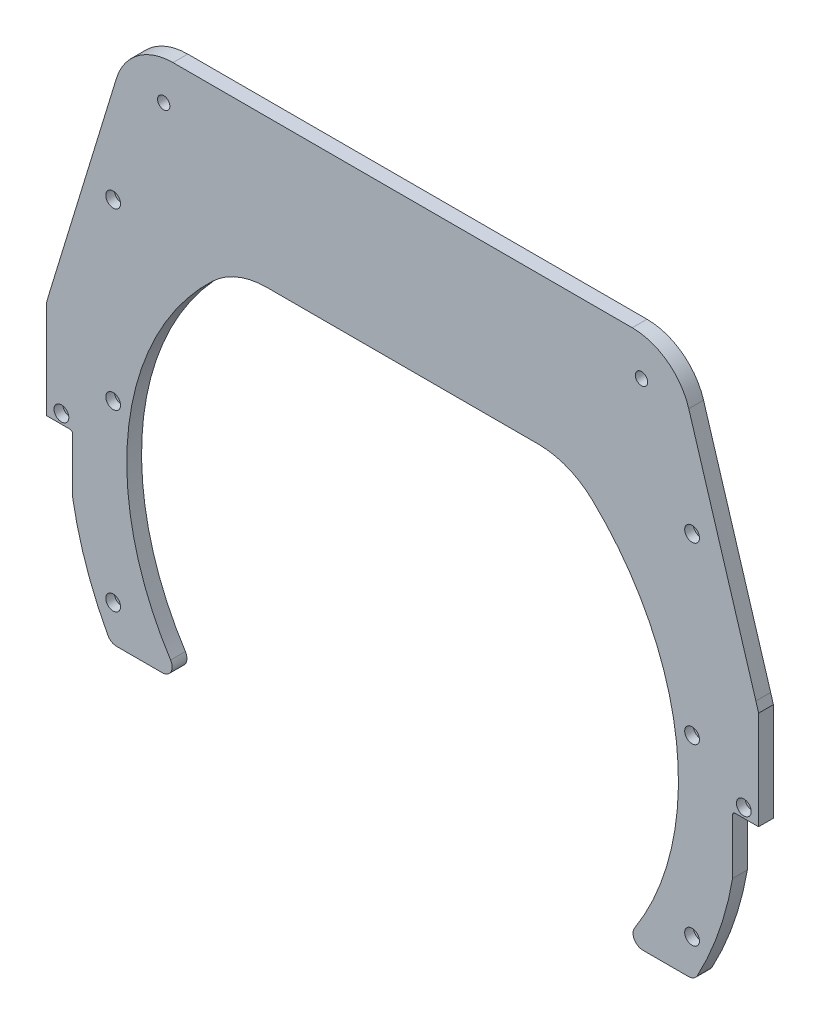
ISO-10303-21;
HEADER;
FILE_DESCRIPTION(('STEP AP214'),'2;1');
FILE_NAME('part.step','',(''),(''),'','','');
FILE_SCHEMA(('AUTOMOTIVE_DESIGN { 1 0 10303 214 1 1 1 1 }'));
ENDSEC;
DATA;
#1=APPLICATION_CONTEXT('core data for automotive mechanical design processes');
#2=APPLICATION_PROTOCOL_DEFINITION('international standard','automotive_design',2000,#1);
#3=PRODUCT_CONTEXT('',#1,'mechanical');
#4=PRODUCT('Part','Part','',(#3));
#5=PRODUCT_RELATED_PRODUCT_CATEGORY('part','',(#4));
#6=PRODUCT_DEFINITION_FORMATION('','',#4);
#7=PRODUCT_DEFINITION_CONTEXT('part definition',#1,'design');
#8=PRODUCT_DEFINITION('design','',#6,#7);
#9=PRODUCT_DEFINITION_SHAPE('','',#8);
#10=(LENGTH_UNIT() NAMED_UNIT(*) SI_UNIT(.MILLI.,.METRE.));
#11=(NAMED_UNIT(*) PLANE_ANGLE_UNIT() SI_UNIT($,.RADIAN.));
#12=(NAMED_UNIT(*) SI_UNIT($,.STERADIAN.) SOLID_ANGLE_UNIT());
#13=UNCERTAINTY_MEASURE_WITH_UNIT(LENGTH_MEASURE(1.E-05),#10,'distance_accuracy_value','');
#14=(GEOMETRIC_REPRESENTATION_CONTEXT(3) GLOBAL_UNCERTAINTY_ASSIGNED_CONTEXT((#13)) GLOBAL_UNIT_ASSIGNED_CONTEXT((#10,
#11,#12)) REPRESENTATION_CONTEXT('',''));
#15=CARTESIAN_POINT('',(0.,0.,0.));
#16=DIRECTION('',(0.,0.,1.));
#17=DIRECTION('',(1.,0.,0.));
#18=AXIS2_PLACEMENT_3D('',#15,#16,#17);
#19=CARTESIAN_POINT('',(0.,0.,4.7625));
#20=DIRECTION('',(0.,0.,-1.));
#21=DIRECTION('',(-1.,0.,0.));
#22=AXIS2_PLACEMENT_3D('',#19,#20,#21);
#23=CYLINDRICAL_SURFACE('',#22,238.125);
#24=CARTESIAN_POINT('',(0.,0.,4.7625));
#25=DIRECTION('',(0.,0.,1.));
#26=DIRECTION('',(1.,0.,0.));
#27=AXIS2_PLACEMENT_3D('',#24,#25,#26);
#28=CIRCLE('',#27,238.125);
#29=CARTESIAN_POINT('',(229.4509,63.685164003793,4.7625));
#30=VERTEX_POINT('',#29);
#31=CARTESIAN_POINT('',(227.720070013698,69.621012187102,4.7625));
#32=VERTEX_POINT('',#31);
#33=EDGE_CURVE('E323',#30,#32,#28,.T.);
#34=ORIENTED_EDGE('',*,*,#33,.F.);
#35=DIRECTION('',(0.,0.,1.));
#36=VECTOR('',#35,1.);
#37=CARTESIAN_POINT('',(229.4509,63.685164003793,-4.7625));
#38=LINE('',#37,#36);
#39=CARTESIAN_POINT('',(229.4509,63.685164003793,-4.7625));
#40=VERTEX_POINT('',#39);
#41=EDGE_CURVE('E254',#40,#30,#38,.T.);
#42=ORIENTED_EDGE('',*,*,#41,.F.);
#43=CARTESIAN_POINT('',(0.,0.,-4.7625));
#44=DIRECTION('',(0.,0.,1.));
#45=DIRECTION('',(1.,0.,0.));
#46=AXIS2_PLACEMENT_3D('',#43,#44,#45);
#47=CIRCLE('',#46,238.125);
#48=CARTESIAN_POINT('',(227.720070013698,69.621012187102,-4.7625));
#49=VERTEX_POINT('',#48);
#50=EDGE_CURVE('E326',#40,#49,#47,.T.);
#51=ORIENTED_EDGE('',*,*,#50,.T.);
#52=DIRECTION('',(0.,0.,1.));
#53=VECTOR('',#52,1.);
#54=CARTESIAN_POINT('',(227.720070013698,69.621012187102,-288.046852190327));
#55=LINE('',#54,#53);
#56=EDGE_CURVE('E444',#49,#32,#55,.T.);
#57=ORIENTED_EDGE('',*,*,#56,.T.);
#58=EDGE_LOOP('',(#34,#42,#51,#57));
#59=FACE_BOUND('',#58,.T.);
#60=ADVANCED_FACE('F42',(#59),#23,.T.);
#61=CARTESIAN_POINT('',(-227.720070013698,69.621012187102,-4.7625));
#62=VERTEX_POINT('',#61);
#63=CARTESIAN_POINT('',(-229.4509,63.685164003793,-4.7625));
#64=VERTEX_POINT('',#63);
#65=EDGE_CURVE('E316',#62,#64,#47,.T.);
#66=ORIENTED_EDGE('',*,*,#65,.T.);
#67=DIRECTION('',(0.,0.,1.));
#68=VECTOR('',#67,1.);
#69=CARTESIAN_POINT('',(-229.4509,63.685164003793,-4.7625));
#70=LINE('',#69,#68);
#71=CARTESIAN_POINT('',(-229.4509,63.685164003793,4.7625));
#72=VERTEX_POINT('',#71);
#73=EDGE_CURVE('E502',#64,#72,#70,.T.);
#74=ORIENTED_EDGE('',*,*,#73,.T.);
#75=CARTESIAN_POINT('',(-227.720070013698,69.6210121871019,4.7625));
#76=VERTEX_POINT('',#75);
#77=EDGE_CURVE('E325',#76,#72,#28,.T.);
#78=ORIENTED_EDGE('',*,*,#77,.F.);
#79=DIRECTION('',(0.,0.,1.));
#80=VECTOR('',#79,1.);
#81=CARTESIAN_POINT('',(-227.720070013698,69.621012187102,-288.046852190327));
#82=LINE('',#81,#80);
#83=EDGE_CURVE('E455',#62,#76,#82,.T.);
#84=ORIENTED_EDGE('',*,*,#83,.F.);
#85=EDGE_LOOP('',(#66,#74,#78,#84));
#86=FACE_BOUND('',#85,.T.);
#87=ADVANCED_FACE('F608',(#86),#23,.T.);
#88=CARTESIAN_POINT('',(0.,0.,4.7625));
#89=DIRECTION('',(0.,0.,1.));
#90=DIRECTION('',(1.,0.,0.));
#91=AXIS2_PLACEMENT_3D('',#88,#89,#90);
#92=PLANE('',#91);
#93=DIRECTION('',(0.,-1.,0.));
#94=VECTOR('',#93,1.);
#95=CARTESIAN_POINT('',(229.4509,63.685164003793,4.7625));
#96=LINE('',#95,#94);
#97=CARTESIAN_POINT('',(229.4509,0.254000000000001,4.7625));
#98=VERTEX_POINT('',#97);
#99=EDGE_CURVE('E244',#30,#98,#96,.T.);
#100=ORIENTED_EDGE('',*,*,#99,.F.);
#101=ORIENTED_EDGE('',*,*,#33,.T.);
#102=DIRECTION('',(0.292371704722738,-0.956304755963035,0.));
#103=VECTOR('',#102,1.);
#104=CARTESIAN_POINT('',(227.720070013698,69.621012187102,4.7625));
#105=LINE('',#104,#103);
#106=CARTESIAN_POINT('',(184.445925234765,211.164361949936,4.7625));
#107=VERTEX_POINT('',#106);
#108=EDGE_CURVE('E441',#107,#32,#105,.T.);
#109=ORIENTED_EDGE('',*,*,#108,.F.);
#110=CARTESIAN_POINT('',(148.010714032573,200.025,4.7625));
#111=DIRECTION('',(0.,0.,1.));
#112=DIRECTION('',(1.,0.,0.));
#113=AXIS2_PLACEMENT_3D('',#110,#111,#112);
#114=CIRCLE('',#113,38.1);
#115=CARTESIAN_POINT('',(148.010714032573,238.125,4.7625));
#116=VERTEX_POINT('',#115);
#117=EDGE_CURVE('E369',#107,#116,#114,.T.);
#118=ORIENTED_EDGE('',*,*,#117,.T.);
#119=DIRECTION('',(-1.,0.,0.));
#120=VECTOR('',#119,1.);
#121=CARTESIAN_POINT('',(-176.203230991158,238.125000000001,4.7625));
#122=LINE('',#121,#120);
#123=CARTESIAN_POINT('',(-148.010714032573,238.125000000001,4.7625));
#124=VERTEX_POINT('',#123);
#125=EDGE_CURVE('E450',#116,#124,#122,.T.);
#126=ORIENTED_EDGE('',*,*,#125,.T.);
#127=CARTESIAN_POINT('',(-148.010714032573,200.025000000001,4.7625));
#128=DIRECTION('',(0.,0.,1.));
#129=DIRECTION('',(1.,0.,0.));
#130=AXIS2_PLACEMENT_3D('',#127,#128,#129);
#131=CIRCLE('',#130,38.1);
#132=CARTESIAN_POINT('',(-184.445925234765,211.164361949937,4.7625));
#133=VERTEX_POINT('',#132);
#134=EDGE_CURVE('E367',#124,#133,#131,.T.);
#135=ORIENTED_EDGE('',*,*,#134,.T.);
#136=DIRECTION('',(-0.292371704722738,-0.956304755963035,0.));
#137=VECTOR('',#136,1.);
#138=CARTESIAN_POINT('',(-227.720070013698,69.621012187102,4.7625));
#139=LINE('',#138,#137);
#140=EDGE_CURVE('E458',#133,#76,#139,.T.);
#141=ORIENTED_EDGE('',*,*,#140,.T.);
#142=ORIENTED_EDGE('',*,*,#77,.T.);
#143=DIRECTION('',(0.,1.,0.));
#144=VECTOR('',#143,1.);
#145=CARTESIAN_POINT('',(-229.4509,0.254000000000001,4.7625));
#146=LINE('',#145,#144);
#147=CARTESIAN_POINT('',(-229.4509,0.254000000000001,4.7625));
#148=VERTEX_POINT('',#147);
#149=EDGE_CURVE('E402',#148,#72,#146,.T.);
#150=ORIENTED_EDGE('',*,*,#149,.F.);
#151=DIRECTION('',(1.,0.,0.));
#152=VECTOR('',#151,1.);
#153=CARTESIAN_POINT('',(-238.124864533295,0.254000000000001,4.7625));
#154=LINE('',#153,#152);
#155=CARTESIAN_POINT('',(-214.3125,0.254000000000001,4.7625));
#156=VERTEX_POINT('',#155);
#157=EDGE_CURVE('E265',#148,#156,#154,.T.);
#158=ORIENTED_EDGE('',*,*,#157,.T.);
#159=CARTESIAN_POINT('',(-214.3125,-1.3335,4.7625));
#160=DIRECTION('',(0.,0.,1.));
#161=DIRECTION('',(1.,0.,0.));
#162=AXIS2_PLACEMENT_3D('',#159,#160,#161);
#163=CIRCLE('',#162,1.5875);
#164=CARTESIAN_POINT('',(-212.725,-1.3335,4.7625));
#165=VERTEX_POINT('',#164);
#166=EDGE_CURVE('E51',#156,#165,#163,.F.);
#167=ORIENTED_EDGE('',*,*,#166,.T.);
#168=DIRECTION('',(0.,1.,0.));
#169=VECTOR('',#168,1.);
#170=CARTESIAN_POINT('',(-212.725,0.254000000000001,4.7625));
#171=LINE('',#170,#169);
#172=CARTESIAN_POINT('',(-212.725,-36.8901663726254,4.7625));
#173=VERTEX_POINT('',#172);
#174=EDGE_CURVE('E401',#173,#165,#171,.T.);
#175=ORIENTED_EDGE('',*,*,#174,.F.);
#176=CARTESIAN_POINT('',(0.,0.,4.7625));
#177=DIRECTION('',(0.,0.,1.));
#178=DIRECTION('',(1.,0.,0.));
#179=AXIS2_PLACEMENT_3D('',#176,#177,#178);
#180=CIRCLE('',#179,215.9);
#181=CARTESIAN_POINT('',(-189.955185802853,-102.614995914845,4.7625));
#182=VERTEX_POINT('',#181);
#183=EDGE_CURVE('E261',#173,#182,#180,.T.);
#184=ORIENTED_EDGE('',*,*,#183,.T.);
#185=CARTESIAN_POINT('',(-184.368268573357,-99.5969077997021,4.7625));
#186=DIRECTION('',(0.,0.,1.));
#187=DIRECTION('',(1.,0.,0.));
#188=AXIS2_PLACEMENT_3D('',#185,#186,#187);
#189=CIRCLE('',#188,6.35);
#190=CARTESIAN_POINT('',(-184.368268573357,-105.946907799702,4.7625));
#191=VERTEX_POINT('',#190);
#192=EDGE_CURVE('E344',#182,#191,#189,.T.);
#193=ORIENTED_EDGE('',*,*,#192,.T.);
#194=DIRECTION('',(1.,0.,0.));
#195=VECTOR('',#194,1.);
#196=CARTESIAN_POINT('',(-188.11715160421,-105.946907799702,4.7625));
#197=LINE('',#196,#195);
#198=CARTESIAN_POINT('',(-154.892473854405,-105.946907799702,4.7625));
#199=VERTEX_POINT('',#198);
#200=EDGE_CURVE('E280',#191,#199,#197,.T.);
#201=ORIENTED_EDGE('',*,*,#200,.T.);
#202=CARTESIAN_POINT('',(-154.892473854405,-99.5969077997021,4.7625));
#203=DIRECTION('',(0.,0.,1.));
#204=DIRECTION('',(1.,0.,0.));
#205=AXIS2_PLACEMENT_3D('',#202,#203,#204);
#206=CIRCLE('',#205,6.35);
#207=CARTESIAN_POINT('',(-149.551354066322,-96.1625316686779,4.7625));
#208=VERTEX_POINT('',#207);
#209=EDGE_CURVE('E342',#199,#208,#206,.T.);
#210=ORIENTED_EDGE('',*,*,#209,.T.);
#211=CARTESIAN_POINT('',(0.,0.,4.7625));
#212=DIRECTION('',(0.,0.,1.));
#213=DIRECTION('',(1.,0.,0.));
#214=AXIS2_PLACEMENT_3D('',#211,#212,#213);
#215=CIRCLE('',#214,177.8);
#216=CARTESIAN_POINT('',(-122.459548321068,128.905,4.7625));
#217=VERTEX_POINT('',#216);
#218=EDGE_CURVE('E287',#217,#208,#215,.T.);
#219=ORIENTED_EDGE('',*,*,#218,.F.);
#220=CARTESIAN_POINT('',(-87.47110594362,92.075,4.7625));
#221=DIRECTION('',(0.,0.,1.));
#222=DIRECTION('',(1.,0.,0.));
#223=AXIS2_PLACEMENT_3D('',#220,#221,#222);
#224=CIRCLE('',#223,50.8);
#225=CARTESIAN_POINT('',(-87.47110594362,142.875,4.7625));
#226=VERTEX_POINT('',#225);
#227=EDGE_CURVE('E308',#226,#217,#224,.T.);
#228=ORIENTED_EDGE('',*,*,#227,.F.);
#229=DIRECTION('',(-1.,0.,0.));
#230=VECTOR('',#229,1.);
#231=CARTESIAN_POINT('',(-87.47110594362,142.875,4.7625));
#232=LINE('',#231,#230);
#233=CARTESIAN_POINT('',(87.47110594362,142.875,4.7625));
#234=VERTEX_POINT('',#233);
#235=EDGE_CURVE('E305',#234,#226,#232,.T.);
#236=ORIENTED_EDGE('',*,*,#235,.F.);
#237=CARTESIAN_POINT('',(87.47110594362,92.075,4.7625));
#238=DIRECTION('',(0.,0.,1.));
#239=DIRECTION('',(1.,0.,0.));
#240=AXIS2_PLACEMENT_3D('',#237,#238,#239);
#241=CIRCLE('',#240,50.8);
#242=CARTESIAN_POINT('',(122.459548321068,128.905,4.7625));
#243=VERTEX_POINT('',#242);
#244=EDGE_CURVE('E302',#243,#234,#241,.T.);
#245=ORIENTED_EDGE('',*,*,#244,.F.);
#246=CARTESIAN_POINT('',(0.,0.,4.7625));
#247=DIRECTION('',(0.,0.,1.));
#248=DIRECTION('',(1.,0.,0.));
#249=AXIS2_PLACEMENT_3D('',#246,#247,#248);
#250=CIRCLE('',#249,177.8);
#251=CARTESIAN_POINT('',(149.551354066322,-96.1625316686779,4.7625));
#252=VERTEX_POINT('',#251);
#253=EDGE_CURVE('E276',#252,#243,#250,.T.);
#254=ORIENTED_EDGE('',*,*,#253,.F.);
#255=CARTESIAN_POINT('',(154.892473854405,-99.5969077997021,4.7625));
#256=DIRECTION('',(0.,0.,1.));
#257=DIRECTION('',(1.,0.,0.));
#258=AXIS2_PLACEMENT_3D('',#255,#256,#257);
#259=CIRCLE('',#258,6.35);
#260=CARTESIAN_POINT('',(154.892473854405,-105.946907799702,4.7625));
#261=VERTEX_POINT('',#260);
#262=EDGE_CURVE('E346',#252,#261,#259,.T.);
#263=ORIENTED_EDGE('',*,*,#262,.T.);
#264=CARTESIAN_POINT('',(184.368268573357,-105.946907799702,4.7625));
#265=VERTEX_POINT('',#264);
#266=EDGE_CURVE('E465',#261,#265,#197,.T.);
#267=ORIENTED_EDGE('',*,*,#266,.T.);
#268=CARTESIAN_POINT('',(184.368268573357,-99.5969077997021,4.7625));
#269=DIRECTION('',(0.,0.,1.));
#270=DIRECTION('',(1.,0.,0.));
#271=AXIS2_PLACEMENT_3D('',#268,#269,#270);
#272=CIRCLE('',#271,6.35);
#273=CARTESIAN_POINT('',(189.955185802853,-102.614995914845,4.7625));
#274=VERTEX_POINT('',#273);
#275=EDGE_CURVE('E348',#265,#274,#272,.T.);
#276=ORIENTED_EDGE('',*,*,#275,.T.);
#277=CARTESIAN_POINT('',(0.,0.,4.7625));
#278=DIRECTION('',(0.,0.,1.));
#279=DIRECTION('',(-1.,0.,0.));
#280=AXIS2_PLACEMENT_3D('',#277,#278,#279);
#281=CIRCLE('',#280,215.9);
#282=CARTESIAN_POINT('',(212.725,-36.8901663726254,4.7625));
#283=VERTEX_POINT('',#282);
#284=EDGE_CURVE('E277',#274,#283,#281,.T.);
#285=ORIENTED_EDGE('',*,*,#284,.T.);
#286=DIRECTION('',(0.,-1.,0.));
#287=VECTOR('',#286,1.);
#288=CARTESIAN_POINT('',(212.725,0.254000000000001,4.7625));
#289=LINE('',#288,#287);
#290=CARTESIAN_POINT('',(212.725,-1.3335,4.7625));
#291=VERTEX_POINT('',#290);
#292=EDGE_CURVE('E250',#291,#283,#289,.T.);
#293=ORIENTED_EDGE('',*,*,#292,.F.);
#294=CARTESIAN_POINT('',(214.3125,-1.3335,4.7625));
#295=DIRECTION('',(0.,0.,1.));
#296=DIRECTION('',(1.,0.,0.));
#297=AXIS2_PLACEMENT_3D('',#294,#295,#296);
#298=CIRCLE('',#297,1.5875);
#299=CARTESIAN_POINT('',(214.3125,0.254000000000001,4.7625));
#300=VERTEX_POINT('',#299);
#301=EDGE_CURVE('E397',#291,#300,#298,.F.);
#302=ORIENTED_EDGE('',*,*,#301,.T.);
#303=DIRECTION('',(1.,0.,0.));
#304=VECTOR('',#303,1.);
#305=CARTESIAN_POINT('',(238.124864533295,0.254000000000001,4.7625));
#306=LINE('',#305,#304);
#307=EDGE_CURVE('E279',#300,#98,#306,.T.);
#308=ORIENTED_EDGE('',*,*,#307,.T.);
#309=EDGE_LOOP('',(#100,#101,#109,#118,#126,#135,#141,#142,#150,#158,#167,#175,#184,#193,#201,
#210,#219,#228,#236,#245,#254,#263,#267,#276,#285,#293,#302,#308));
#310=FACE_BOUND('',#309,.T.);
#311=CARTESIAN_POINT('',(-153.9875,212.725,4.7625));
#312=DIRECTION('',(0.,0.,1.));
#313=DIRECTION('',(1.,0.,0.));
#314=AXIS2_PLACEMENT_3D('',#311,#312,#313);
#315=CIRCLE('',#314,3.96874999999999);
#316=CARTESIAN_POINT('',(-150.01875,212.725,4.7625));
#317=VERTEX_POINT('',#316);
#318=EDGE_CURVE('E387',#317,#317,#315,.T.);
#319=ORIENTED_EDGE('',*,*,#318,.F.);
#320=EDGE_LOOP('',(#319));
#321=FACE_BOUND('',#320,.T.);
#322=CARTESIAN_POINT('',(153.9875,212.725,4.7625));
#323=DIRECTION('',(0.,0.,1.));
#324=DIRECTION('',(1.,0.,0.));
#325=AXIS2_PLACEMENT_3D('',#322,#323,#324);
#326=CIRCLE('',#325,3.96874999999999);
#327=CARTESIAN_POINT('',(157.95625,212.725,4.7625));
#328=VERTEX_POINT('',#327);
#329=EDGE_CURVE('E386',#328,#328,#326,.T.);
#330=ORIENTED_EDGE('',*,*,#329,.F.);
#331=EDGE_LOOP('',(#330));
#332=FACE_BOUND('',#331,.T.);
#333=CARTESIAN_POINT('',(-186.59475,-82.55,4.7625));
#334=DIRECTION('',(0.,0.,1.));
#335=DIRECTION('',(1.,0.,0.));
#336=AXIS2_PLACEMENT_3D('',#333,#334,#335);
#337=CIRCLE('',#336,4.7625);
#338=CARTESIAN_POINT('',(-181.83225,-82.55,4.7625));
#339=VERTEX_POINT('',#338);
#340=EDGE_CURVE('E513',#339,#339,#337,.T.);
#341=ORIENTED_EDGE('',*,*,#340,.F.);
#342=EDGE_LOOP('',(#341));
#343=FACE_BOUND('',#342,.T.);
#344=CARTESIAN_POINT('',(-186.59475,29.9257291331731,4.7625));
#345=DIRECTION('',(0.,0.,1.));
#346=DIRECTION('',(1.,0.,0.));
#347=AXIS2_PLACEMENT_3D('',#344,#345,#346);
#348=CIRCLE('',#347,4.7625);
#349=CARTESIAN_POINT('',(-181.83225,29.9257291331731,4.7625));
#350=VERTEX_POINT('',#349);
#351=EDGE_CURVE('E525',#350,#350,#348,.T.);
#352=ORIENTED_EDGE('',*,*,#351,.F.);
#353=EDGE_LOOP('',(#352));
#354=FACE_BOUND('',#353,.T.);
#355=CARTESIAN_POINT('',(-186.59475,142.401458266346,4.7625));
#356=DIRECTION('',(0.,0.,1.));
#357=DIRECTION('',(1.,0.,0.));
#358=AXIS2_PLACEMENT_3D('',#355,#356,#357);
#359=CIRCLE('',#358,4.7625);
#360=CARTESIAN_POINT('',(-181.83225,142.401458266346,4.7625));
#361=VERTEX_POINT('',#360);
#362=EDGE_CURVE('E537',#361,#361,#359,.T.);
#363=ORIENTED_EDGE('',*,*,#362,.F.);
#364=EDGE_LOOP('',(#363));
#365=FACE_BOUND('',#364,.T.);
#366=CARTESIAN_POINT('',(186.59475,142.401458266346,4.7625));
#367=DIRECTION('',(0.,0.,1.));
#368=DIRECTION('',(1.,0.,0.));
#369=AXIS2_PLACEMENT_3D('',#366,#367,#368);
#370=CIRCLE('',#369,4.7625);
#371=CARTESIAN_POINT('',(191.35725,142.401458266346,4.7625));
#372=VERTEX_POINT('',#371);
#373=EDGE_CURVE('E549',#372,#372,#370,.T.);
#374=ORIENTED_EDGE('',*,*,#373,.F.);
#375=EDGE_LOOP('',(#374));
#376=FACE_BOUND('',#375,.T.);
#377=CARTESIAN_POINT('',(186.59475,29.9257291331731,4.7625));
#378=DIRECTION('',(0.,0.,1.));
#379=DIRECTION('',(1.,0.,0.));
#380=AXIS2_PLACEMENT_3D('',#377,#378,#379);
#381=CIRCLE('',#380,4.7625);
#382=CARTESIAN_POINT('',(191.35725,29.9257291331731,4.7625));
#383=VERTEX_POINT('',#382);
#384=EDGE_CURVE('E561',#383,#383,#381,.T.);
#385=ORIENTED_EDGE('',*,*,#384,.F.);
#386=EDGE_LOOP('',(#385));
#387=FACE_BOUND('',#386,.T.);
#388=CARTESIAN_POINT('',(186.59475,-82.55,4.7625));
#389=DIRECTION('',(0.,0.,1.));
#390=DIRECTION('',(1.,0.,0.));
#391=AXIS2_PLACEMENT_3D('',#388,#389,#390);
#392=CIRCLE('',#391,4.7625);
#393=CARTESIAN_POINT('',(191.35725,-82.55,4.7625));
#394=VERTEX_POINT('',#393);
#395=EDGE_CURVE('E573',#394,#394,#392,.T.);
#396=ORIENTED_EDGE('',*,*,#395,.F.);
#397=EDGE_LOOP('',(#396));
#398=FACE_BOUND('',#397,.T.);
#399=CARTESIAN_POINT('',(-219.93225,6.35,4.7625));
#400=DIRECTION('',(0.,0.,1.));
#401=DIRECTION('',(1.,0.,0.));
#402=AXIS2_PLACEMENT_3D('',#399,#400,#401);
#403=CIRCLE('',#402,4.7625);
#404=CARTESIAN_POINT('',(-215.16975,6.35,4.7625));
#405=VERTEX_POINT('',#404);
#406=EDGE_CURVE('E410',#405,#405,#403,.T.);
#407=ORIENTED_EDGE('',*,*,#406,.F.);
#408=EDGE_LOOP('',(#407));
#409=FACE_BOUND('',#408,.T.);
#410=CARTESIAN_POINT('',(219.93225,6.35,4.7625));
#411=DIRECTION('',(0.,0.,1.));
#412=DIRECTION('',(1.,0.,0.));
#413=AXIS2_PLACEMENT_3D('',#410,#411,#412);
#414=CIRCLE('',#413,4.7625);
#415=CARTESIAN_POINT('',(224.69475,6.35,4.7625));
#416=VERTEX_POINT('',#415);
#417=EDGE_CURVE('E425',#416,#416,#414,.T.);
#418=ORIENTED_EDGE('',*,*,#417,.F.);
#419=EDGE_LOOP('',(#418));
#420=FACE_BOUND('',#419,.T.);
#421=ADVANCED_FACE('F485',(#310,#321,#332,#343,#354,#365,#376,#387,#398,#409,#420),#92,.T.);
#422=CARTESIAN_POINT('',(0.,0.,-4.7625));
#423=DIRECTION('',(0.,0.,1.));
#424=DIRECTION('',(1.,0.,0.));
#425=AXIS2_PLACEMENT_3D('',#422,#423,#424);
#426=PLANE('',#425);
#427=CARTESIAN_POINT('',(-153.9875,212.725,-4.7625));
#428=DIRECTION('',(0.,0.,1.));
#429=DIRECTION('',(1.,0.,0.));
#430=AXIS2_PLACEMENT_3D('',#427,#428,#429);
#431=CIRCLE('',#430,3.96874999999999);
#432=CARTESIAN_POINT('',(-150.01875,212.725,-4.7625));
#433=VERTEX_POINT('',#432);
#434=EDGE_CURVE('E383',#433,#433,#431,.T.);
#435=ORIENTED_EDGE('',*,*,#434,.T.);
#436=EDGE_LOOP('',(#435));
#437=FACE_BOUND('',#436,.T.);
#438=CARTESIAN_POINT('',(153.9875,212.725,-4.7625));
#439=DIRECTION('',(0.,0.,1.));
#440=DIRECTION('',(1.,0.,0.));
#441=AXIS2_PLACEMENT_3D('',#438,#439,#440);
#442=CIRCLE('',#441,3.96874999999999);
#443=CARTESIAN_POINT('',(157.95625,212.725,-4.7625));
#444=VERTEX_POINT('',#443);
#445=EDGE_CURVE('E510',#444,#444,#442,.T.);
#446=ORIENTED_EDGE('',*,*,#445,.T.);
#447=EDGE_LOOP('',(#446));
#448=FACE_BOUND('',#447,.T.);
#449=CARTESIAN_POINT('',(-186.59475,-82.55,-4.7625));
#450=DIRECTION('',(0.,0.,1.));
#451=DIRECTION('',(1.,0.,0.));
#452=AXIS2_PLACEMENT_3D('',#449,#450,#451);
#453=CIRCLE('',#452,2.8067);
#454=CARTESIAN_POINT('',(-183.78805,-82.55,-4.7625));
#455=VERTEX_POINT('',#454);
#456=EDGE_CURVE('E522',#455,#455,#453,.T.);
#457=ORIENTED_EDGE('',*,*,#456,.T.);
#458=EDGE_LOOP('',(#457));
#459=FACE_BOUND('',#458,.T.);
#460=CARTESIAN_POINT('',(-186.59475,29.9257291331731,-4.7625));
#461=DIRECTION('',(0.,0.,1.));
#462=DIRECTION('',(1.,0.,0.));
#463=AXIS2_PLACEMENT_3D('',#460,#461,#462);
#464=CIRCLE('',#463,2.8067);
#465=CARTESIAN_POINT('',(-183.78805,29.9257291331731,-4.7625));
#466=VERTEX_POINT('',#465);
#467=EDGE_CURVE('E534',#466,#466,#464,.T.);
#468=ORIENTED_EDGE('',*,*,#467,.T.);
#469=EDGE_LOOP('',(#468));
#470=FACE_BOUND('',#469,.T.);
#471=CARTESIAN_POINT('',(-186.59475,142.401458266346,-4.7625));
#472=DIRECTION('',(0.,0.,1.));
#473=DIRECTION('',(1.,0.,0.));
#474=AXIS2_PLACEMENT_3D('',#471,#472,#473);
#475=CIRCLE('',#474,2.8067);
#476=CARTESIAN_POINT('',(-183.78805,142.401458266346,-4.7625));
#477=VERTEX_POINT('',#476);
#478=EDGE_CURVE('E546',#477,#477,#475,.T.);
#479=ORIENTED_EDGE('',*,*,#478,.T.);
#480=EDGE_LOOP('',(#479));
#481=FACE_BOUND('',#480,.T.);
#482=CARTESIAN_POINT('',(186.59475,142.401458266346,-4.7625));
#483=DIRECTION('',(0.,0.,1.));
#484=DIRECTION('',(1.,0.,0.));
#485=AXIS2_PLACEMENT_3D('',#482,#483,#484);
#486=CIRCLE('',#485,2.8067);
#487=CARTESIAN_POINT('',(189.40145,142.401458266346,-4.7625));
#488=VERTEX_POINT('',#487);
#489=EDGE_CURVE('E558',#488,#488,#486,.T.);
#490=ORIENTED_EDGE('',*,*,#489,.T.);
#491=EDGE_LOOP('',(#490));
#492=FACE_BOUND('',#491,.T.);
#493=CARTESIAN_POINT('',(186.59475,29.9257291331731,-4.7625));
#494=DIRECTION('',(0.,0.,1.));
#495=DIRECTION('',(1.,0.,0.));
#496=AXIS2_PLACEMENT_3D('',#493,#494,#495);
#497=CIRCLE('',#496,2.8067);
#498=CARTESIAN_POINT('',(189.40145,29.9257291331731,-4.7625));
#499=VERTEX_POINT('',#498);
#500=EDGE_CURVE('E570',#499,#499,#497,.T.);
#501=ORIENTED_EDGE('',*,*,#500,.T.);
#502=EDGE_LOOP('',(#501));
#503=FACE_BOUND('',#502,.T.);
#504=CARTESIAN_POINT('',(186.59475,-82.55,-4.7625));
#505=DIRECTION('',(0.,0.,1.));
#506=DIRECTION('',(1.,0.,0.));
#507=AXIS2_PLACEMENT_3D('',#504,#505,#506);
#508=CIRCLE('',#507,2.8067);
#509=CARTESIAN_POINT('',(189.40145,-82.55,-4.7625));
#510=VERTEX_POINT('',#509);
#511=EDGE_CURVE('E414',#510,#510,#508,.T.);
#512=ORIENTED_EDGE('',*,*,#511,.T.);
#513=EDGE_LOOP('',(#512));
#514=FACE_BOUND('',#513,.T.);
#515=CARTESIAN_POINT('',(-219.93225,6.35,-4.7625));
#516=DIRECTION('',(0.,0.,1.));
#517=DIRECTION('',(1.,0.,0.));
#518=AXIS2_PLACEMENT_3D('',#515,#516,#517);
#519=CIRCLE('',#518,2.8067);
#520=CARTESIAN_POINT('',(-217.12555,6.35,-4.7625));
#521=VERTEX_POINT('',#520);
#522=EDGE_CURVE('E419',#521,#521,#519,.T.);
#523=ORIENTED_EDGE('',*,*,#522,.T.);
#524=EDGE_LOOP('',(#523));
#525=FACE_BOUND('',#524,.T.);
#526=CARTESIAN_POINT('',(219.93225,6.35,-4.7625));
#527=DIRECTION('',(0.,0.,1.));
#528=DIRECTION('',(1.,0.,0.));
#529=AXIS2_PLACEMENT_3D('',#526,#527,#528);
#530=CIRCLE('',#529,2.8067);
#531=CARTESIAN_POINT('',(222.73895,6.35,-4.7625));
#532=VERTEX_POINT('',#531);
#533=EDGE_CURVE('E438',#532,#532,#530,.T.);
#534=ORIENTED_EDGE('',*,*,#533,.T.);
#535=EDGE_LOOP('',(#534));
#536=FACE_BOUND('',#535,.T.);
#537=ORIENTED_EDGE('',*,*,#50,.F.);
#538=DIRECTION('',(0.,-1.,0.));
#539=VECTOR('',#538,1.);
#540=CARTESIAN_POINT('',(229.4509,63.685164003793,-4.7625));
#541=LINE('',#540,#539);
#542=CARTESIAN_POINT('',(229.4509,0.254000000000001,-4.7625));
#543=VERTEX_POINT('',#542);
#544=EDGE_CURVE('E243',#40,#543,#541,.T.);
#545=ORIENTED_EDGE('',*,*,#544,.T.);
#546=DIRECTION('',(1.,0.,0.));
#547=VECTOR('',#546,1.);
#548=CARTESIAN_POINT('',(238.124864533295,0.254000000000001,-4.7625));
#549=LINE('',#548,#547);
#550=CARTESIAN_POINT('',(214.3125,0.254000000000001,-4.7625));
#551=VERTEX_POINT('',#550);
#552=EDGE_CURVE('E260',#551,#543,#549,.T.);
#553=ORIENTED_EDGE('',*,*,#552,.F.);
#554=CARTESIAN_POINT('',(214.3125,-1.3335,-4.7625));
#555=DIRECTION('',(0.,0.,1.));
#556=DIRECTION('',(1.,0.,0.));
#557=AXIS2_PLACEMENT_3D('',#554,#555,#556);
#558=CIRCLE('',#557,1.5875);
#559=CARTESIAN_POINT('',(212.725,-1.3335,-4.7625));
#560=VERTEX_POINT('',#559);
#561=EDGE_CURVE('E239',#551,#560,#558,.T.);
#562=ORIENTED_EDGE('',*,*,#561,.T.);
#563=DIRECTION('',(0.,-1.,0.));
#564=VECTOR('',#563,1.);
#565=CARTESIAN_POINT('',(212.725,0.254000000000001,-4.7625));
#566=LINE('',#565,#564);
#567=CARTESIAN_POINT('',(212.725,-36.8901663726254,-4.7625));
#568=VERTEX_POINT('',#567);
#569=EDGE_CURVE('E231',#560,#568,#566,.T.);
#570=ORIENTED_EDGE('',*,*,#569,.T.);
#571=CARTESIAN_POINT('',(0.,0.,-4.7625));
#572=DIRECTION('',(0.,0.,1.));
#573=DIRECTION('',(-1.,0.,0.));
#574=AXIS2_PLACEMENT_3D('',#571,#572,#573);
#575=CIRCLE('',#574,215.9);
#576=CARTESIAN_POINT('',(189.955185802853,-102.614995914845,-4.7625));
#577=VERTEX_POINT('',#576);
#578=EDGE_CURVE('E236',#577,#568,#575,.T.);
#579=ORIENTED_EDGE('',*,*,#578,.F.);
#580=CARTESIAN_POINT('',(184.368268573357,-99.5969077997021,-4.7625));
#581=DIRECTION('',(0.,0.,1.));
#582=DIRECTION('',(1.,0.,0.));
#583=AXIS2_PLACEMENT_3D('',#580,#581,#582);
#584=CIRCLE('',#583,6.35);
#585=CARTESIAN_POINT('',(184.368268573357,-105.946907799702,-4.7625));
#586=VERTEX_POINT('',#585);
#587=EDGE_CURVE('E336',#577,#586,#584,.F.);
#588=ORIENTED_EDGE('',*,*,#587,.T.);
#589=DIRECTION('',(1.,0.,0.));
#590=VECTOR('',#589,1.);
#591=CARTESIAN_POINT('',(-188.11715160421,-105.946907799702,-4.7625));
#592=LINE('',#591,#590);
#593=CARTESIAN_POINT('',(154.892473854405,-105.946907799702,-4.7625));
#594=VERTEX_POINT('',#593);
#595=EDGE_CURVE('E463',#594,#586,#592,.T.);
#596=ORIENTED_EDGE('',*,*,#595,.F.);
#597=CARTESIAN_POINT('',(154.892473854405,-99.5969077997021,-4.7625));
#598=DIRECTION('',(0.,0.,1.));
#599=DIRECTION('',(1.,0.,0.));
#600=AXIS2_PLACEMENT_3D('',#597,#598,#599);
#601=CIRCLE('',#600,6.35);
#602=CARTESIAN_POINT('',(149.551354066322,-96.1625316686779,-4.7625));
#603=VERTEX_POINT('',#602);
#604=EDGE_CURVE('E334',#594,#603,#601,.F.);
#605=ORIENTED_EDGE('',*,*,#604,.T.);
#606=CARTESIAN_POINT('',(0.,0.,-4.7625));
#607=DIRECTION('',(0.,0.,1.));
#608=DIRECTION('',(1.,0.,0.));
#609=AXIS2_PLACEMENT_3D('',#606,#607,#608);
#610=CIRCLE('',#609,177.8);
#611=CARTESIAN_POINT('',(122.459548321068,128.905,-4.7625));
#612=VERTEX_POINT('',#611);
#613=EDGE_CURVE('E284',#603,#612,#610,.T.);
#614=ORIENTED_EDGE('',*,*,#613,.T.);
#615=CARTESIAN_POINT('',(87.47110594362,92.075,-4.7625));
#616=DIRECTION('',(0.,0.,1.));
#617=DIRECTION('',(1.,0.,0.));
#618=AXIS2_PLACEMENT_3D('',#615,#616,#617);
#619=CIRCLE('',#618,50.8);
#620=CARTESIAN_POINT('',(87.47110594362,142.875,-4.7625));
#621=VERTEX_POINT('',#620);
#622=EDGE_CURVE('E286',#612,#621,#619,.T.);
#623=ORIENTED_EDGE('',*,*,#622,.T.);
#624=DIRECTION('',(-1.,0.,0.));
#625=VECTOR('',#624,1.);
#626=CARTESIAN_POINT('',(-87.47110594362,142.875,-4.7625));
#627=LINE('',#626,#625);
#628=CARTESIAN_POINT('',(-87.47110594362,142.875,-4.7625));
#629=VERTEX_POINT('',#628);
#630=EDGE_CURVE('E290',#621,#629,#627,.T.);
#631=ORIENTED_EDGE('',*,*,#630,.T.);
#632=CARTESIAN_POINT('',(-87.47110594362,92.075,-4.7625));
#633=DIRECTION('',(0.,0.,1.));
#634=DIRECTION('',(1.,0.,0.));
#635=AXIS2_PLACEMENT_3D('',#632,#633,#634);
#636=CIRCLE('',#635,50.8);
#637=CARTESIAN_POINT('',(-122.459548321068,128.905,-4.7625));
#638=VERTEX_POINT('',#637);
#639=EDGE_CURVE('E293',#629,#638,#636,.T.);
#640=ORIENTED_EDGE('',*,*,#639,.T.);
#641=CARTESIAN_POINT('',(0.,0.,-4.7625));
#642=DIRECTION('',(0.,0.,1.));
#643=DIRECTION('',(1.,0.,0.));
#644=AXIS2_PLACEMENT_3D('',#641,#642,#643);
#645=CIRCLE('',#644,177.8);
#646=CARTESIAN_POINT('',(-149.551354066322,-96.1625316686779,-4.7625));
#647=VERTEX_POINT('',#646);
#648=EDGE_CURVE('E296',#638,#647,#645,.T.);
#649=ORIENTED_EDGE('',*,*,#648,.T.);
#650=CARTESIAN_POINT('',(-154.892473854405,-99.5969077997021,-4.7625));
#651=DIRECTION('',(0.,0.,1.));
#652=DIRECTION('',(1.,0.,0.));
#653=AXIS2_PLACEMENT_3D('',#650,#651,#652);
#654=CIRCLE('',#653,6.35);
#655=CARTESIAN_POINT('',(-154.892473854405,-105.946907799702,-4.7625));
#656=VERTEX_POINT('',#655);
#657=EDGE_CURVE('E329',#647,#656,#654,.F.);
#658=ORIENTED_EDGE('',*,*,#657,.T.);
#659=CARTESIAN_POINT('',(-184.368268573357,-105.946907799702,-4.7625));
#660=VERTEX_POINT('',#659);
#661=EDGE_CURVE('E268',#660,#656,#592,.T.);
#662=ORIENTED_EDGE('',*,*,#661,.F.);
#663=CARTESIAN_POINT('',(-184.368268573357,-99.5969077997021,-4.7625));
#664=DIRECTION('',(0.,0.,1.));
#665=DIRECTION('',(1.,0.,0.));
#666=AXIS2_PLACEMENT_3D('',#663,#664,#665);
#667=CIRCLE('',#666,6.35);
#668=CARTESIAN_POINT('',(-189.955185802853,-102.614995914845,-4.7625));
#669=VERTEX_POINT('',#668);
#670=EDGE_CURVE('E331',#660,#669,#667,.F.);
#671=ORIENTED_EDGE('',*,*,#670,.T.);
#672=CARTESIAN_POINT('',(0.,0.,-4.7625));
#673=DIRECTION('',(0.,0.,1.));
#674=DIRECTION('',(1.,0.,0.));
#675=AXIS2_PLACEMENT_3D('',#672,#673,#674);
#676=CIRCLE('',#675,215.9);
#677=CARTESIAN_POINT('',(-212.725,-36.8901663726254,-4.7625));
#678=VERTEX_POINT('',#677);
#679=EDGE_CURVE('E274',#678,#669,#676,.T.);
#680=ORIENTED_EDGE('',*,*,#679,.F.);
#681=DIRECTION('',(0.,1.,0.));
#682=VECTOR('',#681,1.);
#683=CARTESIAN_POINT('',(-212.725,0.254000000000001,-4.7625));
#684=LINE('',#683,#682);
#685=CARTESIAN_POINT('',(-212.725,-1.3335,-4.7625));
#686=VERTEX_POINT('',#685);
#687=EDGE_CURVE('E406',#678,#686,#684,.T.);
#688=ORIENTED_EDGE('',*,*,#687,.T.);
#689=CARTESIAN_POINT('',(-214.3125,-1.3335,-4.7625));
#690=DIRECTION('',(0.,0.,1.));
#691=DIRECTION('',(1.,0.,0.));
#692=AXIS2_PLACEMENT_3D('',#689,#690,#691);
#693=CIRCLE('',#692,1.5875);
#694=CARTESIAN_POINT('',(-214.3125,0.254000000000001,-4.7625));
#695=VERTEX_POINT('',#694);
#696=EDGE_CURVE('E12',#686,#695,#693,.T.);
#697=ORIENTED_EDGE('',*,*,#696,.T.);
#698=DIRECTION('',(1.,0.,0.));
#699=VECTOR('',#698,1.);
#700=CARTESIAN_POINT('',(-238.124864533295,0.254000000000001,-4.7625));
#701=LINE('',#700,#699);
#702=CARTESIAN_POINT('',(-229.4509,0.254000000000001,-4.7625));
#703=VERTEX_POINT('',#702);
#704=EDGE_CURVE('E263',#703,#695,#701,.T.);
#705=ORIENTED_EDGE('',*,*,#704,.F.);
#706=DIRECTION('',(0.,1.,0.));
#707=VECTOR('',#706,1.);
#708=CARTESIAN_POINT('',(-229.4509,0.254000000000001,-4.7625));
#709=LINE('',#708,#707);
#710=EDGE_CURVE('E408',#703,#64,#709,.T.);
#711=ORIENTED_EDGE('',*,*,#710,.T.);
#712=ORIENTED_EDGE('',*,*,#65,.F.);
#713=DIRECTION('',(0.292371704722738,0.956304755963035,0.));
#714=VECTOR('',#713,1.);
#715=CARTESIAN_POINT('',(-227.720070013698,69.621012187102,-4.7625));
#716=LINE('',#715,#714);
#717=CARTESIAN_POINT('',(-184.445925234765,211.164361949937,-4.7625));
#718=VERTEX_POINT('',#717);
#719=EDGE_CURVE('E451',#62,#718,#716,.T.);
#720=ORIENTED_EDGE('',*,*,#719,.T.);
#721=CARTESIAN_POINT('',(-148.010714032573,200.025000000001,-4.7625));
#722=DIRECTION('',(0.,0.,1.));
#723=DIRECTION('',(1.,0.,0.));
#724=AXIS2_PLACEMENT_3D('',#721,#722,#723);
#725=CIRCLE('',#724,38.1);
#726=CARTESIAN_POINT('',(-148.010714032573,238.125000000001,-4.7625));
#727=VERTEX_POINT('',#726);
#728=EDGE_CURVE('E376',#718,#727,#725,.F.);
#729=ORIENTED_EDGE('',*,*,#728,.T.);
#730=DIRECTION('',(1.,0.,0.));
#731=VECTOR('',#730,1.);
#732=CARTESIAN_POINT('',(-176.203230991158,238.125000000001,-4.7625));
#733=LINE('',#732,#731);
#734=CARTESIAN_POINT('',(148.010714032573,238.125,-4.7625));
#735=VERTEX_POINT('',#734);
#736=EDGE_CURVE('E454',#727,#735,#733,.T.);
#737=ORIENTED_EDGE('',*,*,#736,.T.);
#738=CARTESIAN_POINT('',(148.010714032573,200.025,-4.7625));
#739=DIRECTION('',(0.,0.,1.));
#740=DIRECTION('',(1.,0.,0.));
#741=AXIS2_PLACEMENT_3D('',#738,#739,#740);
#742=CIRCLE('',#741,38.1);
#743=CARTESIAN_POINT('',(184.445925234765,211.164361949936,-4.7625));
#744=VERTEX_POINT('',#743);
#745=EDGE_CURVE('E378',#735,#744,#742,.F.);
#746=ORIENTED_EDGE('',*,*,#745,.T.);
#747=DIRECTION('',(-0.292371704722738,0.956304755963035,0.));
#748=VECTOR('',#747,1.);
#749=CARTESIAN_POINT('',(227.720070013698,69.621012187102,-4.7625));
#750=LINE('',#749,#748);
#751=EDGE_CURVE('E447',#49,#744,#750,.T.);
#752=ORIENTED_EDGE('',*,*,#751,.F.);
#753=EDGE_LOOP('',(#537,#545,#553,#562,#570,#579,#588,#596,#605,#614,#623,#631,#640,#649,#658,
#662,#671,#680,#688,#697,#705,#711,#712,#720,#729,#737,#746,#752));
#754=FACE_BOUND('',#753,.T.);
#755=ADVANCED_FACE('F234',(#437,#448,#459,#470,#481,#492,#503,#514,#525,#536,#754),#426,.F.);
#756=CARTESIAN_POINT('',(0.,0.,-4.7625));
#757=DIRECTION('',(0.,0.,1.));
#758=DIRECTION('',(1.,0.,0.));
#759=AXIS2_PLACEMENT_3D('',#756,#757,#758);
#760=CYLINDRICAL_SURFACE('',#759,177.8);
#761=ORIENTED_EDGE('',*,*,#218,.T.);
#762=DIRECTION('',(0.,0.,1.));
#763=VECTOR('',#762,1.);
#764=CARTESIAN_POINT('',(-149.551354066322,-96.1625316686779,-4.7625));
#765=LINE('',#764,#763);
#766=EDGE_CURVE('E361',#208,#647,#765,.F.);
#767=ORIENTED_EDGE('',*,*,#766,.T.);
#768=ORIENTED_EDGE('',*,*,#648,.F.);
#769=DIRECTION('',(0.,0.,1.));
#770=VECTOR('',#769,1.);
#771=CARTESIAN_POINT('',(-122.459548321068,128.905,-4.7625));
#772=LINE('',#771,#770);
#773=EDGE_CURVE('E314',#638,#217,#772,.T.);
#774=ORIENTED_EDGE('',*,*,#773,.T.);
#775=EDGE_LOOP('',(#761,#767,#768,#774));
#776=FACE_BOUND('',#775,.T.);
#777=ADVANCED_FACE('F724',(#776),#760,.F.);
#778=CARTESIAN_POINT('',(-87.47110594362,92.075,-4.7625));
#779=DIRECTION('',(0.,0.,1.));
#780=DIRECTION('',(1.,0.,0.));
#781=AXIS2_PLACEMENT_3D('',#778,#779,#780);
#782=CYLINDRICAL_SURFACE('',#781,50.8);
#783=ORIENTED_EDGE('',*,*,#227,.T.);
#784=ORIENTED_EDGE('',*,*,#773,.F.);
#785=ORIENTED_EDGE('',*,*,#639,.F.);
#786=DIRECTION('',(0.,0.,1.));
#787=VECTOR('',#786,1.);
#788=CARTESIAN_POINT('',(-87.47110594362,142.875,-4.7625));
#789=LINE('',#788,#787);
#790=EDGE_CURVE('E317',#629,#226,#789,.T.);
#791=ORIENTED_EDGE('',*,*,#790,.T.);
#792=EDGE_LOOP('',(#783,#784,#785,#791));
#793=FACE_BOUND('',#792,.T.);
#794=ADVANCED_FACE('F730',(#793),#782,.F.);
#795=CARTESIAN_POINT('',(-87.47110594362,142.875,-4.7625));
#796=DIRECTION('',(0.,1.,0.));
#797=DIRECTION('',(0.,0.,1.));
#798=AXIS2_PLACEMENT_3D('',#795,#796,#797);
#799=PLANE('',#798);
#800=ORIENTED_EDGE('',*,*,#235,.T.);
#801=ORIENTED_EDGE('',*,*,#790,.F.);
#802=ORIENTED_EDGE('',*,*,#630,.F.);
#803=DIRECTION('',(0.,0.,1.));
#804=VECTOR('',#803,1.);
#805=CARTESIAN_POINT('',(87.47110594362,142.875,-4.7625));
#806=LINE('',#805,#804);
#807=EDGE_CURVE('E319',#621,#234,#806,.T.);
#808=ORIENTED_EDGE('',*,*,#807,.T.);
#809=EDGE_LOOP('',(#800,#801,#802,#808));
#810=FACE_BOUND('',#809,.T.);
#811=ADVANCED_FACE('F734',(#810),#799,.F.);
#812=CARTESIAN_POINT('',(87.47110594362,92.075,-4.7625));
#813=DIRECTION('',(0.,0.,1.));
#814=DIRECTION('',(1.,0.,0.));
#815=AXIS2_PLACEMENT_3D('',#812,#813,#814);
#816=CYLINDRICAL_SURFACE('',#815,50.8);
#817=ORIENTED_EDGE('',*,*,#244,.T.);
#818=ORIENTED_EDGE('',*,*,#807,.F.);
#819=ORIENTED_EDGE('',*,*,#622,.F.);
#820=DIRECTION('',(0.,0.,1.));
#821=VECTOR('',#820,1.);
#822=CARTESIAN_POINT('',(122.459548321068,128.905,-4.7625));
#823=LINE('',#822,#821);
#824=EDGE_CURVE('E300',#612,#243,#823,.T.);
#825=ORIENTED_EDGE('',*,*,#824,.T.);
#826=EDGE_LOOP('',(#817,#818,#819,#825));
#827=FACE_BOUND('',#826,.T.);
#828=ADVANCED_FACE('F737',(#827),#816,.F.);
#829=CARTESIAN_POINT('',(0.,0.,-4.7625));
#830=DIRECTION('',(0.,0.,1.));
#831=DIRECTION('',(1.,0.,0.));
#832=AXIS2_PLACEMENT_3D('',#829,#830,#831);
#833=CYLINDRICAL_SURFACE('',#832,177.8);
#834=ORIENTED_EDGE('',*,*,#613,.F.);
#835=DIRECTION('',(0.,0.,1.));
#836=VECTOR('',#835,1.);
#837=CARTESIAN_POINT('',(149.551354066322,-96.1625316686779,-4.7625));
#838=LINE('',#837,#836);
#839=EDGE_CURVE('E350',#603,#252,#838,.T.);
#840=ORIENTED_EDGE('',*,*,#839,.T.);
#841=ORIENTED_EDGE('',*,*,#253,.T.);
#842=ORIENTED_EDGE('',*,*,#824,.F.);
#843=EDGE_LOOP('',(#834,#840,#841,#842));
#844=FACE_BOUND('',#843,.T.);
#845=ADVANCED_FACE('F742',(#844),#833,.F.);
#846=CARTESIAN_POINT('',(0.,0.,-4.7625));
#847=DIRECTION('',(0.,0.,1.));
#848=DIRECTION('',(1.,0.,0.));
#849=AXIS2_PLACEMENT_3D('',#846,#847,#848);
#850=CYLINDRICAL_SURFACE('',#849,215.9);
#851=DIRECTION('',(0.,0.,1.));
#852=VECTOR('',#851,1.);
#853=CARTESIAN_POINT('',(212.725,-36.8901663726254,-4.7625));
#854=LINE('',#853,#852);
#855=EDGE_CURVE('E247',#568,#283,#854,.T.);
#856=ORIENTED_EDGE('',*,*,#855,.T.);
#857=ORIENTED_EDGE('',*,*,#284,.F.);
#858=DIRECTION('',(0.,0.,1.));
#859=VECTOR('',#858,1.);
#860=CARTESIAN_POINT('',(189.955185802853,-102.614995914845,-4.7625));
#861=LINE('',#860,#859);
#862=EDGE_CURVE('E259',#274,#577,#861,.F.);
#863=ORIENTED_EDGE('',*,*,#862,.T.);
#864=ORIENTED_EDGE('',*,*,#578,.T.);
#865=EDGE_LOOP('',(#856,#857,#863,#864));
#866=FACE_BOUND('',#865,.T.);
#867=ADVANCED_FACE('F257',(#866),#850,.T.);
#868=CARTESIAN_POINT('',(0.,0.,-4.7625));
#869=DIRECTION('',(0.,0.,1.));
#870=DIRECTION('',(1.,0.,0.));
#871=AXIS2_PLACEMENT_3D('',#868,#869,#870);
#872=CYLINDRICAL_SURFACE('',#871,215.9);
#873=DIRECTION('',(0.,0.,1.));
#874=VECTOR('',#873,1.);
#875=CARTESIAN_POINT('',(-212.725,-36.8901663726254,-4.7625));
#876=LINE('',#875,#874);
#877=EDGE_CURVE('E500',#678,#173,#876,.T.);
#878=ORIENTED_EDGE('',*,*,#877,.F.);
#879=ORIENTED_EDGE('',*,*,#679,.T.);
#880=DIRECTION('',(0.,0.,1.));
#881=VECTOR('',#880,1.);
#882=CARTESIAN_POINT('',(-189.955185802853,-102.614995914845,-4.7625));
#883=LINE('',#882,#881);
#884=EDGE_CURVE('E358',#669,#182,#883,.T.);
#885=ORIENTED_EDGE('',*,*,#884,.T.);
#886=ORIENTED_EDGE('',*,*,#183,.F.);
#887=EDGE_LOOP('',(#878,#879,#885,#886));
#888=FACE_BOUND('',#887,.T.);
#889=ADVANCED_FACE('F716',(#888),#872,.T.);
#890=CARTESIAN_POINT('',(-238.124864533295,0.254000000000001,-4.7625));
#891=DIRECTION('',(0.,-1.,0.));
#892=DIRECTION('',(0.,0.,-1.));
#893=AXIS2_PLACEMENT_3D('',#890,#891,#892);
#894=PLANE('',#893);
#895=ORIENTED_EDGE('',*,*,#704,.T.);
#896=DIRECTION('',(0.,0.,1.));
#897=VECTOR('',#896,1.);
#898=CARTESIAN_POINT('',(-214.3125,0.254000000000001,-4.7625));
#899=LINE('',#898,#897);
#900=EDGE_CURVE('E391',#695,#156,#899,.T.);
#901=ORIENTED_EDGE('',*,*,#900,.T.);
#902=ORIENTED_EDGE('',*,*,#157,.F.);
#903=DIRECTION('',(0.,0.,1.));
#904=VECTOR('',#903,1.);
#905=CARTESIAN_POINT('',(-229.4509,0.254000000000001,-4.7625));
#906=LINE('',#905,#904);
#907=EDGE_CURVE('E497',#703,#148,#906,.T.);
#908=ORIENTED_EDGE('',*,*,#907,.F.);
#909=EDGE_LOOP('',(#895,#901,#902,#908));
#910=FACE_BOUND('',#909,.T.);
#911=ADVANCED_FACE('F707',(#910),#894,.T.);
#912=CARTESIAN_POINT('',(238.124864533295,0.254000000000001,-4.7625));
#913=DIRECTION('',(0.,-1.,0.));
#914=DIRECTION('',(0.,0.,-1.));
#915=AXIS2_PLACEMENT_3D('',#912,#913,#914);
#916=PLANE('',#915);
#917=ORIENTED_EDGE('',*,*,#307,.F.);
#918=DIRECTION('',(0.,0.,1.));
#919=VECTOR('',#918,1.);
#920=CARTESIAN_POINT('',(214.3125,0.254000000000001,-4.7625));
#921=LINE('',#920,#919);
#922=EDGE_CURVE('E389',#300,#551,#921,.F.);
#923=ORIENTED_EDGE('',*,*,#922,.T.);
#924=ORIENTED_EDGE('',*,*,#552,.T.);
#925=DIRECTION('',(0.,0.,1.));
#926=VECTOR('',#925,1.);
#927=CARTESIAN_POINT('',(229.4509,0.254000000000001,-4.7625));
#928=LINE('',#927,#926);
#929=EDGE_CURVE('E403',#543,#98,#928,.T.);
#930=ORIENTED_EDGE('',*,*,#929,.T.);
#931=EDGE_LOOP('',(#917,#923,#924,#930));
#932=FACE_BOUND('',#931,.T.);
#933=ADVANCED_FACE('F676',(#932),#916,.T.);
#934=CARTESIAN_POINT('',(-188.11715160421,-105.946907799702,4.7625));
#935=DIRECTION('',(0.,1.,0.));
#936=DIRECTION('',(0.,0.,1.));
#937=AXIS2_PLACEMENT_3D('',#934,#935,#936);
#938=PLANE('',#937);
#939=ORIENTED_EDGE('',*,*,#200,.F.);
#940=DIRECTION('',(0.,0.,-1.));
#941=VECTOR('',#940,1.);
#942=CARTESIAN_POINT('',(-184.368268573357,-105.946907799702,-4.7625));
#943=LINE('',#942,#941);
#944=EDGE_CURVE('E355',#191,#660,#943,.T.);
#945=ORIENTED_EDGE('',*,*,#944,.T.);
#946=ORIENTED_EDGE('',*,*,#661,.T.);
#947=DIRECTION('',(0.,0.,1.));
#948=VECTOR('',#947,1.);
#949=CARTESIAN_POINT('',(-154.892473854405,-105.946907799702,4.7625));
#950=LINE('',#949,#948);
#951=EDGE_CURVE('E353',#656,#199,#950,.T.);
#952=ORIENTED_EDGE('',*,*,#951,.T.);
#953=EDGE_LOOP('',(#939,#945,#946,#952));
#954=FACE_BOUND('',#953,.T.);
#955=ADVANCED_FACE('F720',(#954),#938,.F.);
#956=ORIENTED_EDGE('',*,*,#595,.T.);
#957=DIRECTION('',(0.,0.,-1.));
#958=VECTOR('',#957,1.);
#959=CARTESIAN_POINT('',(184.368268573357,-105.946907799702,4.7625));
#960=LINE('',#959,#958);
#961=EDGE_CURVE('E340',#586,#265,#960,.F.);
#962=ORIENTED_EDGE('',*,*,#961,.T.);
#963=ORIENTED_EDGE('',*,*,#266,.F.);
#964=DIRECTION('',(0.,0.,1.));
#965=VECTOR('',#964,1.);
#966=CARTESIAN_POINT('',(154.892473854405,-105.946907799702,4.7625));
#967=LINE('',#966,#965);
#968=EDGE_CURVE('E338',#261,#594,#967,.F.);
#969=ORIENTED_EDGE('',*,*,#968,.T.);
#970=EDGE_LOOP('',(#956,#962,#963,#969));
#971=FACE_BOUND('',#970,.T.);
#972=ADVANCED_FACE('F479',(#971),#938,.F.);
#973=CARTESIAN_POINT('',(184.368268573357,-99.5969077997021,-4.7625));
#974=DIRECTION('',(0.,0.,1.));
#975=DIRECTION('',(1.,0.,0.));
#976=AXIS2_PLACEMENT_3D('',#973,#974,#975);
#977=CYLINDRICAL_SURFACE('',#976,6.35);
#978=ORIENTED_EDGE('',*,*,#275,.F.);
#979=ORIENTED_EDGE('',*,*,#961,.F.);
#980=ORIENTED_EDGE('',*,*,#587,.F.);
#981=ORIENTED_EDGE('',*,*,#862,.F.);
#982=EDGE_LOOP('',(#978,#979,#980,#981));
#983=FACE_BOUND('',#982,.T.);
#984=ADVANCED_FACE('F483',(#983),#977,.T.);
#985=CARTESIAN_POINT('',(154.892473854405,-99.5969077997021,-4.7625));
#986=DIRECTION('',(0.,0.,1.));
#987=DIRECTION('',(1.,0.,0.));
#988=AXIS2_PLACEMENT_3D('',#985,#986,#987);
#989=CYLINDRICAL_SURFACE('',#988,6.35);
#990=ORIENTED_EDGE('',*,*,#604,.F.);
#991=ORIENTED_EDGE('',*,*,#968,.F.);
#992=ORIENTED_EDGE('',*,*,#262,.F.);
#993=ORIENTED_EDGE('',*,*,#839,.F.);
#994=EDGE_LOOP('',(#990,#991,#992,#993));
#995=FACE_BOUND('',#994,.T.);
#996=ADVANCED_FACE('F643',(#995),#989,.T.);
#997=CARTESIAN_POINT('',(-184.368268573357,-99.5969077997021,-4.7625));
#998=DIRECTION('',(0.,0.,1.));
#999=DIRECTION('',(1.,0.,0.));
#1000=AXIS2_PLACEMENT_3D('',#997,#998,#999);
#1001=CYLINDRICAL_SURFACE('',#1000,6.35);
#1002=ORIENTED_EDGE('',*,*,#192,.F.);
#1003=ORIENTED_EDGE('',*,*,#884,.F.);
#1004=ORIENTED_EDGE('',*,*,#670,.F.);
#1005=ORIENTED_EDGE('',*,*,#944,.F.);
#1006=EDGE_LOOP('',(#1002,#1003,#1004,#1005));
#1007=FACE_BOUND('',#1006,.T.);
#1008=ADVANCED_FACE('F646',(#1007),#1001,.T.);
#1009=CARTESIAN_POINT('',(-154.892473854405,-99.5969077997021,-4.7625));
#1010=DIRECTION('',(0.,0.,1.));
#1011=DIRECTION('',(1.,0.,0.));
#1012=AXIS2_PLACEMENT_3D('',#1009,#1010,#1011);
#1013=CYLINDRICAL_SURFACE('',#1012,6.35);
#1014=ORIENTED_EDGE('',*,*,#209,.F.);
#1015=ORIENTED_EDGE('',*,*,#951,.F.);
#1016=ORIENTED_EDGE('',*,*,#657,.F.);
#1017=ORIENTED_EDGE('',*,*,#766,.F.);
#1018=EDGE_LOOP('',(#1014,#1015,#1016,#1017));
#1019=FACE_BOUND('',#1018,.T.);
#1020=ADVANCED_FACE('F650',(#1019),#1013,.T.);
#1021=CARTESIAN_POINT('',(-227.720070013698,69.621012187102,-288.046852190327));
#1022=DIRECTION('',(-0.956304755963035,0.292371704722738,0.));
#1023=DIRECTION('',(-0.292371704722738,-0.956304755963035,0.));
#1024=AXIS2_PLACEMENT_3D('',#1021,#1022,#1023);
#1025=PLANE('',#1024);
#1026=ORIENTED_EDGE('',*,*,#140,.F.);
#1027=DIRECTION('',(0.,0.,1.));
#1028=VECTOR('',#1027,1.);
#1029=CARTESIAN_POINT('',(-184.445925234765,211.164361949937,-288.046852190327));
#1030=LINE('',#1029,#1028);
#1031=EDGE_CURVE('E380',#133,#718,#1030,.F.);
#1032=ORIENTED_EDGE('',*,*,#1031,.T.);
#1033=ORIENTED_EDGE('',*,*,#719,.F.);
#1034=ORIENTED_EDGE('',*,*,#83,.T.);
#1035=EDGE_LOOP('',(#1026,#1032,#1033,#1034));
#1036=FACE_BOUND('',#1035,.T.);
#1037=ADVANCED_FACE('F654',(#1036),#1025,.T.);
#1038=CARTESIAN_POINT('',(-176.203230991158,238.125000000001,-288.046852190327));
#1039=DIRECTION('',(0.,1.,0.));
#1040=DIRECTION('',(-1.,0.,0.));
#1041=AXIS2_PLACEMENT_3D('',#1038,#1039,#1040);
#1042=PLANE('',#1041);
#1043=ORIENTED_EDGE('',*,*,#125,.F.);
#1044=DIRECTION('',(0.,0.,1.));
#1045=VECTOR('',#1044,1.);
#1046=CARTESIAN_POINT('',(148.010714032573,238.125,-4.76250000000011));
#1047=LINE('',#1046,#1045);
#1048=EDGE_CURVE('E374',#116,#735,#1047,.F.);
#1049=ORIENTED_EDGE('',*,*,#1048,.T.);
#1050=ORIENTED_EDGE('',*,*,#736,.F.);
#1051=DIRECTION('',(0.,0.,1.));
#1052=VECTOR('',#1051,1.);
#1053=CARTESIAN_POINT('',(-148.010714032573,238.125000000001,-288.046852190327));
#1054=LINE('',#1053,#1052);
#1055=EDGE_CURVE('E371',#727,#124,#1054,.T.);
#1056=ORIENTED_EDGE('',*,*,#1055,.T.);
#1057=EDGE_LOOP('',(#1043,#1049,#1050,#1056));
#1058=FACE_BOUND('',#1057,.T.);
#1059=ADVANCED_FACE('F690',(#1058),#1042,.T.);
#1060=CARTESIAN_POINT('',(227.720070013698,69.621012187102,-288.046852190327));
#1061=DIRECTION('',(-0.956304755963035,-0.292371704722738,0.));
#1062=DIRECTION('',(0.292371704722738,-0.956304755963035,0.));
#1063=AXIS2_PLACEMENT_3D('',#1060,#1061,#1062);
#1064=PLANE('',#1063);
#1065=ORIENTED_EDGE('',*,*,#751,.T.);
#1066=DIRECTION('',(0.,0.,1.));
#1067=VECTOR('',#1066,1.);
#1068=CARTESIAN_POINT('',(184.445925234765,211.164361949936,4.76249999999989));
#1069=LINE('',#1068,#1067);
#1070=EDGE_CURVE('E364',#744,#107,#1069,.T.);
#1071=ORIENTED_EDGE('',*,*,#1070,.T.);
#1072=ORIENTED_EDGE('',*,*,#108,.T.);
#1073=ORIENTED_EDGE('',*,*,#56,.F.);
#1074=EDGE_LOOP('',(#1065,#1071,#1072,#1073));
#1075=FACE_BOUND('',#1074,.T.);
#1076=ADVANCED_FACE('F660',(#1075),#1064,.F.);
#1077=CARTESIAN_POINT('',(148.010714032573,200.025,-288.046852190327));
#1078=DIRECTION('',(0.,0.,-1.));
#1079=DIRECTION('',(-1.,0.,0.));
#1080=AXIS2_PLACEMENT_3D('',#1077,#1078,#1079);
#1081=CYLINDRICAL_SURFACE('',#1080,38.1);
#1082=ORIENTED_EDGE('',*,*,#745,.F.);
#1083=ORIENTED_EDGE('',*,*,#1048,.F.);
#1084=ORIENTED_EDGE('',*,*,#117,.F.);
#1085=ORIENTED_EDGE('',*,*,#1070,.F.);
#1086=EDGE_LOOP('',(#1082,#1083,#1084,#1085));
#1087=FACE_BOUND('',#1086,.T.);
#1088=ADVANCED_FACE('F656',(#1087),#1081,.T.);
#1089=CARTESIAN_POINT('',(-148.010714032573,200.025000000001,-288.046852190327));
#1090=DIRECTION('',(0.,0.,1.));
#1091=DIRECTION('',(1.,0.,0.));
#1092=AXIS2_PLACEMENT_3D('',#1089,#1090,#1091);
#1093=CYLINDRICAL_SURFACE('',#1092,38.1);
#1094=ORIENTED_EDGE('',*,*,#728,.F.);
#1095=ORIENTED_EDGE('',*,*,#1031,.F.);
#1096=ORIENTED_EDGE('',*,*,#134,.F.);
#1097=ORIENTED_EDGE('',*,*,#1055,.F.);
#1098=EDGE_LOOP('',(#1094,#1095,#1096,#1097));
#1099=FACE_BOUND('',#1098,.T.);
#1100=ADVANCED_FACE('F659',(#1099),#1093,.T.);
#1101=CARTESIAN_POINT('',(219.93225,6.35,4.7625));
#1102=DIRECTION('',(0.,0.,1.));
#1103=DIRECTION('',(1.,0.,0.));
#1104=AXIS2_PLACEMENT_3D('',#1101,#1102,#1103);
#1105=CYLINDRICAL_SURFACE('',#1104,2.8067);
#1106=ORIENTED_EDGE('',*,*,#533,.F.);
#1107=EDGE_LOOP('',(#1106));
#1108=FACE_BOUND('',#1107,.T.);
#1109=CARTESIAN_POINT('',(219.93225,6.35,-0.8255));
#1110=DIRECTION('',(0.,0.,1.));
#1111=DIRECTION('',(1.,0.,0.));
#1112=AXIS2_PLACEMENT_3D('',#1109,#1110,#1111);
#1113=CIRCLE('',#1112,2.8067);
#1114=CARTESIAN_POINT('',(222.73895,6.35,-0.8255));
#1115=VERTEX_POINT('',#1114);
#1116=EDGE_CURVE('E435',#1115,#1115,#1113,.T.);
#1117=ORIENTED_EDGE('',*,*,#1116,.T.);
#1118=EDGE_LOOP('',(#1117));
#1119=FACE_BOUND('',#1118,.T.);
#1120=ADVANCED_FACE('F627',(#1108,#1119),#1105,.F.);
#1121=CARTESIAN_POINT('',(222.73895,6.35,-0.8255));
#1122=DIRECTION('',(0.,0.,-1.));
#1123=DIRECTION('',(-1.,0.,0.));
#1124=AXIS2_PLACEMENT_3D('',#1121,#1122,#1123);
#1125=PLANE('',#1124);
#1126=ORIENTED_EDGE('',*,*,#1116,.F.);
#1127=EDGE_LOOP('',(#1126));
#1128=FACE_BOUND('',#1127,.T.);
#1129=CARTESIAN_POINT('',(219.93225,6.35,-0.8255));
#1130=DIRECTION('',(0.,0.,1.));
#1131=DIRECTION('',(1.,0.,0.));
#1132=AXIS2_PLACEMENT_3D('',#1129,#1130,#1131);
#1133=CIRCLE('',#1132,4.7625);
#1134=CARTESIAN_POINT('',(224.69475,6.35,-0.8255));
#1135=VERTEX_POINT('',#1134);
#1136=EDGE_CURVE('E430',#1135,#1135,#1133,.T.);
#1137=ORIENTED_EDGE('',*,*,#1136,.T.);
#1138=EDGE_LOOP('',(#1137));
#1139=FACE_BOUND('',#1138,.T.);
#1140=ADVANCED_FACE('F617',(#1128,#1139),#1125,.F.);
#1141=CARTESIAN_POINT('',(219.93225,6.35,4.7625));
#1142=DIRECTION('',(0.,0.,1.));
#1143=DIRECTION('',(1.,0.,0.));
#1144=AXIS2_PLACEMENT_3D('',#1141,#1142,#1143);
#1145=CYLINDRICAL_SURFACE('',#1144,4.7625);
#1146=ORIENTED_EDGE('',*,*,#1136,.F.);
#1147=EDGE_LOOP('',(#1146));
#1148=FACE_BOUND('',#1147,.T.);
#1149=ORIENTED_EDGE('',*,*,#417,.T.);
#1150=EDGE_LOOP('',(#1149));
#1151=FACE_BOUND('',#1150,.T.);
#1152=ADVANCED_FACE('F614',(#1148,#1151),#1145,.F.);
#1153=CARTESIAN_POINT('',(-219.93225,6.35,4.7625));
#1154=DIRECTION('',(0.,0.,1.));
#1155=DIRECTION('',(1.,0.,0.));
#1156=AXIS2_PLACEMENT_3D('',#1153,#1154,#1155);
#1157=CYLINDRICAL_SURFACE('',#1156,2.8067);
#1158=ORIENTED_EDGE('',*,*,#522,.F.);
#1159=EDGE_LOOP('',(#1158));
#1160=FACE_BOUND('',#1159,.T.);
#1161=CARTESIAN_POINT('',(-219.93225,6.35,-0.8255));
#1162=DIRECTION('',(0.,0.,1.));
#1163=DIRECTION('',(1.,0.,0.));
#1164=AXIS2_PLACEMENT_3D('',#1161,#1162,#1163);
#1165=CIRCLE('',#1164,2.8067);
#1166=CARTESIAN_POINT('',(-217.12555,6.35,-0.8255));
#1167=VERTEX_POINT('',#1166);
#1168=EDGE_CURVE('E416',#1167,#1167,#1165,.T.);
#1169=ORIENTED_EDGE('',*,*,#1168,.T.);
#1170=EDGE_LOOP('',(#1169));
#1171=FACE_BOUND('',#1170,.T.);
#1172=ADVANCED_FACE('F616',(#1160,#1171),#1157,.F.);
#1173=CARTESIAN_POINT('',(-217.12555,6.35,-0.8255));
#1174=DIRECTION('',(0.,0.,-1.));
#1175=DIRECTION('',(-1.,0.,0.));
#1176=AXIS2_PLACEMENT_3D('',#1173,#1174,#1175);
#1177=PLANE('',#1176);
#1178=ORIENTED_EDGE('',*,*,#1168,.F.);
#1179=EDGE_LOOP('',(#1178));
#1180=FACE_BOUND('',#1179,.T.);
#1181=CARTESIAN_POINT('',(-219.93225,6.35,-0.8255));
#1182=DIRECTION('',(0.,0.,1.));
#1183=DIRECTION('',(1.,0.,0.));
#1184=AXIS2_PLACEMENT_3D('',#1181,#1182,#1183);
#1185=CIRCLE('',#1184,4.7625);
#1186=CARTESIAN_POINT('',(-215.16975,6.35,-0.8255));
#1187=VERTEX_POINT('',#1186);
#1188=EDGE_CURVE('E413',#1187,#1187,#1185,.T.);
#1189=ORIENTED_EDGE('',*,*,#1188,.T.);
#1190=EDGE_LOOP('',(#1189));
#1191=FACE_BOUND('',#1190,.T.);
#1192=ADVANCED_FACE('F624',(#1180,#1191),#1177,.F.);
#1193=CARTESIAN_POINT('',(-219.93225,6.35,4.7625));
#1194=DIRECTION('',(0.,0.,1.));
#1195=DIRECTION('',(1.,0.,0.));
#1196=AXIS2_PLACEMENT_3D('',#1193,#1194,#1195);
#1197=CYLINDRICAL_SURFACE('',#1196,4.7625);
#1198=ORIENTED_EDGE('',*,*,#1188,.F.);
#1199=EDGE_LOOP('',(#1198));
#1200=FACE_BOUND('',#1199,.T.);
#1201=ORIENTED_EDGE('',*,*,#406,.T.);
#1202=EDGE_LOOP('',(#1201));
#1203=FACE_BOUND('',#1202,.T.);
#1204=ADVANCED_FACE('F590',(#1200,#1203),#1197,.F.);
#1205=CARTESIAN_POINT('',(186.59475,-82.55,4.7625));
#1206=DIRECTION('',(0.,0.,1.));
#1207=DIRECTION('',(1.,0.,0.));
#1208=AXIS2_PLACEMENT_3D('',#1205,#1206,#1207);
#1209=CYLINDRICAL_SURFACE('',#1208,2.8067);
#1210=ORIENTED_EDGE('',*,*,#511,.F.);
#1211=EDGE_LOOP('',(#1210));
#1212=FACE_BOUND('',#1211,.T.);
#1213=CARTESIAN_POINT('',(186.59475,-82.55,-0.8255));
#1214=DIRECTION('',(0.,0.,1.));
#1215=DIRECTION('',(1.,0.,0.));
#1216=AXIS2_PLACEMENT_3D('',#1213,#1214,#1215);
#1217=CIRCLE('',#1216,2.8067);
#1218=CARTESIAN_POINT('',(189.40145,-82.55,-0.8255));
#1219=VERTEX_POINT('',#1218);
#1220=EDGE_CURVE('E579',#1219,#1219,#1217,.T.);
#1221=ORIENTED_EDGE('',*,*,#1220,.T.);
#1222=EDGE_LOOP('',(#1221));
#1223=FACE_BOUND('',#1222,.T.);
#1224=ADVANCED_FACE('F586',(#1212,#1223),#1209,.F.);
#1225=CARTESIAN_POINT('',(189.40145,-82.55,-0.8255));
#1226=DIRECTION('',(0.,0.,-1.));
#1227=DIRECTION('',(-1.,0.,0.));
#1228=AXIS2_PLACEMENT_3D('',#1225,#1226,#1227);
#1229=PLANE('',#1228);
#1230=ORIENTED_EDGE('',*,*,#1220,.F.);
#1231=EDGE_LOOP('',(#1230));
#1232=FACE_BOUND('',#1231,.T.);
#1233=CARTESIAN_POINT('',(186.59475,-82.55,-0.8255));
#1234=DIRECTION('',(0.,0.,1.));
#1235=DIRECTION('',(1.,0.,0.));
#1236=AXIS2_PLACEMENT_3D('',#1233,#1234,#1235);
#1237=CIRCLE('',#1236,4.7625);
#1238=CARTESIAN_POINT('',(191.35725,-82.55,-0.8255));
#1239=VERTEX_POINT('',#1238);
#1240=EDGE_CURVE('E576',#1239,#1239,#1237,.T.);
#1241=ORIENTED_EDGE('',*,*,#1240,.T.);
#1242=EDGE_LOOP('',(#1241));
#1243=FACE_BOUND('',#1242,.T.);
#1244=ADVANCED_FACE('F589',(#1232,#1243),#1229,.F.);
#1245=CARTESIAN_POINT('',(186.59475,-82.55,4.7625));
#1246=DIRECTION('',(0.,0.,1.));
#1247=DIRECTION('',(1.,0.,0.));
#1248=AXIS2_PLACEMENT_3D('',#1245,#1246,#1247);
#1249=CYLINDRICAL_SURFACE('',#1248,4.7625);
#1250=ORIENTED_EDGE('',*,*,#1240,.F.);
#1251=EDGE_LOOP('',(#1250));
#1252=FACE_BOUND('',#1251,.T.);
#1253=ORIENTED_EDGE('',*,*,#395,.T.);
#1254=EDGE_LOOP('',(#1253));
#1255=FACE_BOUND('',#1254,.T.);
#1256=ADVANCED_FACE('F596',(#1252,#1255),#1249,.F.);
#1257=CARTESIAN_POINT('',(186.59475,29.9257291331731,4.7625));
#1258=DIRECTION('',(0.,0.,1.));
#1259=DIRECTION('',(1.,0.,0.));
#1260=AXIS2_PLACEMENT_3D('',#1257,#1258,#1259);
#1261=CYLINDRICAL_SURFACE('',#1260,2.8067);
#1262=ORIENTED_EDGE('',*,*,#500,.F.);
#1263=EDGE_LOOP('',(#1262));
#1264=FACE_BOUND('',#1263,.T.);
#1265=CARTESIAN_POINT('',(186.59475,29.9257291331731,-0.8255));
#1266=DIRECTION('',(0.,0.,1.));
#1267=DIRECTION('',(1.,0.,0.));
#1268=AXIS2_PLACEMENT_3D('',#1265,#1266,#1267);
#1269=CIRCLE('',#1268,2.8067);
#1270=CARTESIAN_POINT('',(189.40145,29.9257291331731,-0.8255));
#1271=VERTEX_POINT('',#1270);
#1272=EDGE_CURVE('E567',#1271,#1271,#1269,.T.);
#1273=ORIENTED_EDGE('',*,*,#1272,.T.);
#1274=EDGE_LOOP('',(#1273));
#1275=FACE_BOUND('',#1274,.T.);
#1276=ADVANCED_FACE('F602',(#1264,#1275),#1261,.F.);
#1277=CARTESIAN_POINT('',(189.40145,29.9257291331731,-0.8255));
#1278=DIRECTION('',(0.,0.,-1.));
#1279=DIRECTION('',(-1.,0.,0.));
#1280=AXIS2_PLACEMENT_3D('',#1277,#1278,#1279);
#1281=PLANE('',#1280);
#1282=ORIENTED_EDGE('',*,*,#1272,.F.);
#1283=EDGE_LOOP('',(#1282));
#1284=FACE_BOUND('',#1283,.T.);
#1285=CARTESIAN_POINT('',(186.59475,29.9257291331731,-0.8255));
#1286=DIRECTION('',(0.,0.,1.));
#1287=DIRECTION('',(1.,0.,0.));
#1288=AXIS2_PLACEMENT_3D('',#1285,#1286,#1287);
#1289=CIRCLE('',#1288,4.7625);
#1290=CARTESIAN_POINT('',(191.35725,29.9257291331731,-0.8255));
#1291=VERTEX_POINT('',#1290);
#1292=EDGE_CURVE('E564',#1291,#1291,#1289,.T.);
#1293=ORIENTED_EDGE('',*,*,#1292,.T.);
#1294=EDGE_LOOP('',(#1293));
#1295=FACE_BOUND('',#1294,.T.);
#1296=ADVANCED_FACE('F802',(#1284,#1295),#1281,.F.);
#1297=CARTESIAN_POINT('',(186.59475,29.9257291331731,4.7625));
#1298=DIRECTION('',(0.,0.,1.));
#1299=DIRECTION('',(1.,0.,0.));
#1300=AXIS2_PLACEMENT_3D('',#1297,#1298,#1299);
#1301=CYLINDRICAL_SURFACE('',#1300,4.7625);
#1302=ORIENTED_EDGE('',*,*,#1292,.F.);
#1303=EDGE_LOOP('',(#1302));
#1304=FACE_BOUND('',#1303,.T.);
#1305=ORIENTED_EDGE('',*,*,#384,.T.);
#1306=EDGE_LOOP('',(#1305));
#1307=FACE_BOUND('',#1306,.T.);
#1308=ADVANCED_FACE('F808',(#1304,#1307),#1301,.F.);
#1309=CARTESIAN_POINT('',(186.59475,142.401458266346,4.7625));
#1310=DIRECTION('',(0.,0.,1.));
#1311=DIRECTION('',(1.,0.,0.));
#1312=AXIS2_PLACEMENT_3D('',#1309,#1310,#1311);
#1313=CYLINDRICAL_SURFACE('',#1312,2.8067);
#1314=ORIENTED_EDGE('',*,*,#489,.F.);
#1315=EDGE_LOOP('',(#1314));
#1316=FACE_BOUND('',#1315,.T.);
#1317=CARTESIAN_POINT('',(186.59475,142.401458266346,-0.8255));
#1318=DIRECTION('',(0.,0.,1.));
#1319=DIRECTION('',(1.,0.,0.));
#1320=AXIS2_PLACEMENT_3D('',#1317,#1318,#1319);
#1321=CIRCLE('',#1320,2.8067);
#1322=CARTESIAN_POINT('',(189.40145,142.401458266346,-0.8255));
#1323=VERTEX_POINT('',#1322);
#1324=EDGE_CURVE('E555',#1323,#1323,#1321,.T.);
#1325=ORIENTED_EDGE('',*,*,#1324,.T.);
#1326=EDGE_LOOP('',(#1325));
#1327=FACE_BOUND('',#1326,.T.);
#1328=ADVANCED_FACE('F814',(#1316,#1327),#1313,.F.);
#1329=CARTESIAN_POINT('',(189.40145,142.401458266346,-0.8255));
#1330=DIRECTION('',(0.,0.,-1.));
#1331=DIRECTION('',(-1.,0.,0.));
#1332=AXIS2_PLACEMENT_3D('',#1329,#1330,#1331);
#1333=PLANE('',#1332);
#1334=ORIENTED_EDGE('',*,*,#1324,.F.);
#1335=EDGE_LOOP('',(#1334));
#1336=FACE_BOUND('',#1335,.T.);
#1337=CARTESIAN_POINT('',(186.59475,142.401458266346,-0.8255));
#1338=DIRECTION('',(0.,0.,1.));
#1339=DIRECTION('',(1.,0.,0.));
#1340=AXIS2_PLACEMENT_3D('',#1337,#1338,#1339);
#1341=CIRCLE('',#1340,4.7625);
#1342=CARTESIAN_POINT('',(191.35725,142.401458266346,-0.8255));
#1343=VERTEX_POINT('',#1342);
#1344=EDGE_CURVE('E552',#1343,#1343,#1341,.T.);
#1345=ORIENTED_EDGE('',*,*,#1344,.T.);
#1346=EDGE_LOOP('',(#1345));
#1347=FACE_BOUND('',#1346,.T.);
#1348=ADVANCED_FACE('F821',(#1336,#1347),#1333,.F.);
#1349=CARTESIAN_POINT('',(186.59475,142.401458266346,4.7625));
#1350=DIRECTION('',(0.,0.,1.));
#1351=DIRECTION('',(1.,0.,0.));
#1352=AXIS2_PLACEMENT_3D('',#1349,#1350,#1351);
#1353=CYLINDRICAL_SURFACE('',#1352,4.7625);
#1354=ORIENTED_EDGE('',*,*,#1344,.F.);
#1355=EDGE_LOOP('',(#1354));
#1356=FACE_BOUND('',#1355,.T.);
#1357=ORIENTED_EDGE('',*,*,#373,.T.);
#1358=EDGE_LOOP('',(#1357));
#1359=FACE_BOUND('',#1358,.T.);
#1360=ADVANCED_FACE('F883',(#1356,#1359),#1353,.F.);
#1361=CARTESIAN_POINT('',(-186.59475,142.401458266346,4.7625));
#1362=DIRECTION('',(0.,0.,1.));
#1363=DIRECTION('',(1.,0.,0.));
#1364=AXIS2_PLACEMENT_3D('',#1361,#1362,#1363);
#1365=CYLINDRICAL_SURFACE('',#1364,2.8067);
#1366=ORIENTED_EDGE('',*,*,#478,.F.);
#1367=EDGE_LOOP('',(#1366));
#1368=FACE_BOUND('',#1367,.T.);
#1369=CARTESIAN_POINT('',(-186.59475,142.401458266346,-0.8255));
#1370=DIRECTION('',(0.,0.,1.));
#1371=DIRECTION('',(1.,0.,0.));
#1372=AXIS2_PLACEMENT_3D('',#1369,#1370,#1371);
#1373=CIRCLE('',#1372,2.8067);
#1374=CARTESIAN_POINT('',(-183.78805,142.401458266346,-0.8255));
#1375=VERTEX_POINT('',#1374);
#1376=EDGE_CURVE('E543',#1375,#1375,#1373,.T.);
#1377=ORIENTED_EDGE('',*,*,#1376,.T.);
#1378=EDGE_LOOP('',(#1377));
#1379=FACE_BOUND('',#1378,.T.);
#1380=ADVANCED_FACE('F892',(#1368,#1379),#1365,.F.);
#1381=CARTESIAN_POINT('',(-183.78805,142.401458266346,-0.8255));
#1382=DIRECTION('',(0.,0.,-1.));
#1383=DIRECTION('',(-1.,0.,0.));
#1384=AXIS2_PLACEMENT_3D('',#1381,#1382,#1383);
#1385=PLANE('',#1384);
#1386=ORIENTED_EDGE('',*,*,#1376,.F.);
#1387=EDGE_LOOP('',(#1386));
#1388=FACE_BOUND('',#1387,.T.);
#1389=CARTESIAN_POINT('',(-186.59475,142.401458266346,-0.8255));
#1390=DIRECTION('',(0.,0.,1.));
#1391=DIRECTION('',(1.,0.,0.));
#1392=AXIS2_PLACEMENT_3D('',#1389,#1390,#1391);
#1393=CIRCLE('',#1392,4.7625);
#1394=CARTESIAN_POINT('',(-181.83225,142.401458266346,-0.8255));
#1395=VERTEX_POINT('',#1394);
#1396=EDGE_CURVE('E540',#1395,#1395,#1393,.T.);
#1397=ORIENTED_EDGE('',*,*,#1396,.T.);
#1398=EDGE_LOOP('',(#1397));
#1399=FACE_BOUND('',#1398,.T.);
#1400=ADVANCED_FACE('F902',(#1388,#1399),#1385,.F.);
#1401=CARTESIAN_POINT('',(-186.59475,142.401458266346,4.7625));
#1402=DIRECTION('',(0.,0.,1.));
#1403=DIRECTION('',(1.,0.,0.));
#1404=AXIS2_PLACEMENT_3D('',#1401,#1402,#1403);
#1405=CYLINDRICAL_SURFACE('',#1404,4.7625);
#1406=ORIENTED_EDGE('',*,*,#1396,.F.);
#1407=EDGE_LOOP('',(#1406));
#1408=FACE_BOUND('',#1407,.T.);
#1409=ORIENTED_EDGE('',*,*,#362,.T.);
#1410=EDGE_LOOP('',(#1409));
#1411=FACE_BOUND('',#1410,.T.);
#1412=ADVANCED_FACE('F912',(#1408,#1411),#1405,.F.);
#1413=CARTESIAN_POINT('',(-186.59475,29.9257291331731,4.7625));
#1414=DIRECTION('',(0.,0.,1.));
#1415=DIRECTION('',(1.,0.,0.));
#1416=AXIS2_PLACEMENT_3D('',#1413,#1414,#1415);
#1417=CYLINDRICAL_SURFACE('',#1416,2.8067);
#1418=ORIENTED_EDGE('',*,*,#467,.F.);
#1419=EDGE_LOOP('',(#1418));
#1420=FACE_BOUND('',#1419,.T.);
#1421=CARTESIAN_POINT('',(-186.59475,29.9257291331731,-0.8255));
#1422=DIRECTION('',(0.,0.,1.));
#1423=DIRECTION('',(1.,0.,0.));
#1424=AXIS2_PLACEMENT_3D('',#1421,#1422,#1423);
#1425=CIRCLE('',#1424,2.8067);
#1426=CARTESIAN_POINT('',(-183.78805,29.9257291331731,-0.8255));
#1427=VERTEX_POINT('',#1426);
#1428=EDGE_CURVE('E531',#1427,#1427,#1425,.T.);
#1429=ORIENTED_EDGE('',*,*,#1428,.T.);
#1430=EDGE_LOOP('',(#1429));
#1431=FACE_BOUND('',#1430,.T.);
#1432=ADVANCED_FACE('F922',(#1420,#1431),#1417,.F.);
#1433=CARTESIAN_POINT('',(-183.78805,29.9257291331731,-0.8255));
#1434=DIRECTION('',(0.,0.,-1.));
#1435=DIRECTION('',(-1.,0.,0.));
#1436=AXIS2_PLACEMENT_3D('',#1433,#1434,#1435);
#1437=PLANE('',#1436);
#1438=ORIENTED_EDGE('',*,*,#1428,.F.);
#1439=EDGE_LOOP('',(#1438));
#1440=FACE_BOUND('',#1439,.T.);
#1441=CARTESIAN_POINT('',(-186.59475,29.9257291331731,-0.8255));
#1442=DIRECTION('',(0.,0.,1.));
#1443=DIRECTION('',(1.,0.,0.));
#1444=AXIS2_PLACEMENT_3D('',#1441,#1442,#1443);
#1445=CIRCLE('',#1444,4.7625);
#1446=CARTESIAN_POINT('',(-181.83225,29.9257291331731,-0.8255));
#1447=VERTEX_POINT('',#1446);
#1448=EDGE_CURVE('E528',#1447,#1447,#1445,.T.);
#1449=ORIENTED_EDGE('',*,*,#1448,.T.);
#1450=EDGE_LOOP('',(#1449));
#1451=FACE_BOUND('',#1450,.T.);
#1452=ADVANCED_FACE('F932',(#1440,#1451),#1437,.F.);
#1453=CARTESIAN_POINT('',(-186.59475,29.9257291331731,4.7625));
#1454=DIRECTION('',(0.,0.,1.));
#1455=DIRECTION('',(1.,0.,0.));
#1456=AXIS2_PLACEMENT_3D('',#1453,#1454,#1455);
#1457=CYLINDRICAL_SURFACE('',#1456,4.7625);
#1458=ORIENTED_EDGE('',*,*,#1448,.F.);
#1459=EDGE_LOOP('',(#1458));
#1460=FACE_BOUND('',#1459,.T.);
#1461=ORIENTED_EDGE('',*,*,#351,.T.);
#1462=EDGE_LOOP('',(#1461));
#1463=FACE_BOUND('',#1462,.T.);
#1464=ADVANCED_FACE('F942',(#1460,#1463),#1457,.F.);
#1465=CARTESIAN_POINT('',(-186.59475,-82.55,4.7625));
#1466=DIRECTION('',(0.,0.,1.));
#1467=DIRECTION('',(1.,0.,0.));
#1468=AXIS2_PLACEMENT_3D('',#1465,#1466,#1467);
#1469=CYLINDRICAL_SURFACE('',#1468,2.8067);
#1470=ORIENTED_EDGE('',*,*,#456,.F.);
#1471=EDGE_LOOP('',(#1470));
#1472=FACE_BOUND('',#1471,.T.);
#1473=CARTESIAN_POINT('',(-186.59475,-82.55,-0.8255));
#1474=DIRECTION('',(0.,0.,1.));
#1475=DIRECTION('',(1.,0.,0.));
#1476=AXIS2_PLACEMENT_3D('',#1473,#1474,#1475);
#1477=CIRCLE('',#1476,2.8067);
#1478=CARTESIAN_POINT('',(-183.78805,-82.55,-0.8255));
#1479=VERTEX_POINT('',#1478);
#1480=EDGE_CURVE('E519',#1479,#1479,#1477,.T.);
#1481=ORIENTED_EDGE('',*,*,#1480,.T.);
#1482=EDGE_LOOP('',(#1481));
#1483=FACE_BOUND('',#1482,.T.);
#1484=ADVANCED_FACE('F952',(#1472,#1483),#1469,.F.);
#1485=CARTESIAN_POINT('',(-183.78805,-82.55,-0.8255));
#1486=DIRECTION('',(0.,0.,-1.));
#1487=DIRECTION('',(-1.,0.,0.));
#1488=AXIS2_PLACEMENT_3D('',#1485,#1486,#1487);
#1489=PLANE('',#1488);
#1490=ORIENTED_EDGE('',*,*,#1480,.F.);
#1491=EDGE_LOOP('',(#1490));
#1492=FACE_BOUND('',#1491,.T.);
#1493=CARTESIAN_POINT('',(-186.59475,-82.55,-0.8255));
#1494=DIRECTION('',(0.,0.,1.));
#1495=DIRECTION('',(1.,0.,0.));
#1496=AXIS2_PLACEMENT_3D('',#1493,#1494,#1495);
#1497=CIRCLE('',#1496,4.7625);
#1498=CARTESIAN_POINT('',(-181.83225,-82.55,-0.8255));
#1499=VERTEX_POINT('',#1498);
#1500=EDGE_CURVE('E516',#1499,#1499,#1497,.T.);
#1501=ORIENTED_EDGE('',*,*,#1500,.T.);
#1502=EDGE_LOOP('',(#1501));
#1503=FACE_BOUND('',#1502,.T.);
#1504=ADVANCED_FACE('F962',(#1492,#1503),#1489,.F.);
#1505=CARTESIAN_POINT('',(-186.59475,-82.55,4.7625));
#1506=DIRECTION('',(0.,0.,1.));
#1507=DIRECTION('',(1.,0.,0.));
#1508=AXIS2_PLACEMENT_3D('',#1505,#1506,#1507);
#1509=CYLINDRICAL_SURFACE('',#1508,4.7625);
#1510=ORIENTED_EDGE('',*,*,#1500,.F.);
#1511=EDGE_LOOP('',(#1510));
#1512=FACE_BOUND('',#1511,.T.);
#1513=ORIENTED_EDGE('',*,*,#340,.T.);
#1514=EDGE_LOOP('',(#1513));
#1515=FACE_BOUND('',#1514,.T.);
#1516=ADVANCED_FACE('F972',(#1512,#1515),#1509,.F.);
#1517=CARTESIAN_POINT('',(153.9875,212.725,4.7625));
#1518=DIRECTION('',(0.,0.,1.));
#1519=DIRECTION('',(1.,0.,0.));
#1520=AXIS2_PLACEMENT_3D('',#1517,#1518,#1519);
#1521=CYLINDRICAL_SURFACE('',#1520,3.96874999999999);
#1522=ORIENTED_EDGE('',*,*,#329,.T.);
#1523=EDGE_LOOP('',(#1522));
#1524=FACE_BOUND('',#1523,.T.);
#1525=ORIENTED_EDGE('',*,*,#445,.F.);
#1526=EDGE_LOOP('',(#1525));
#1527=FACE_BOUND('',#1526,.T.);
#1528=ADVANCED_FACE('F982',(#1524,#1527),#1521,.F.);
#1529=CARTESIAN_POINT('',(-153.9875,212.725,4.7625));
#1530=DIRECTION('',(0.,0.,1.));
#1531=DIRECTION('',(1.,0.,0.));
#1532=AXIS2_PLACEMENT_3D('',#1529,#1530,#1531);
#1533=CYLINDRICAL_SURFACE('',#1532,3.96874999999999);
#1534=ORIENTED_EDGE('',*,*,#318,.T.);
#1535=EDGE_LOOP('',(#1534));
#1536=FACE_BOUND('',#1535,.T.);
#1537=ORIENTED_EDGE('',*,*,#434,.F.);
#1538=EDGE_LOOP('',(#1537));
#1539=FACE_BOUND('',#1538,.T.);
#1540=ADVANCED_FACE('F993',(#1536,#1539),#1533,.F.);
#1541=CARTESIAN_POINT('',(-229.4509,0.254000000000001,-4.7625));
#1542=DIRECTION('',(1.,0.,0.));
#1543=DIRECTION('',(0.,1.,0.));
#1544=AXIS2_PLACEMENT_3D('',#1541,#1542,#1543);
#1545=PLANE('',#1544);
#1546=ORIENTED_EDGE('',*,*,#149,.T.);
#1547=ORIENTED_EDGE('',*,*,#73,.F.);
#1548=ORIENTED_EDGE('',*,*,#710,.F.);
#1549=ORIENTED_EDGE('',*,*,#907,.T.);
#1550=EDGE_LOOP('',(#1546,#1547,#1548,#1549));
#1551=FACE_BOUND('',#1550,.T.);
#1552=ADVANCED_FACE('F1003',(#1551),#1545,.F.);
#1553=CARTESIAN_POINT('',(-212.725,0.254000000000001,-4.7625));
#1554=DIRECTION('',(1.,0.,0.));
#1555=DIRECTION('',(0.,1.,0.));
#1556=AXIS2_PLACEMENT_3D('',#1553,#1554,#1555);
#1557=PLANE('',#1556);
#1558=ORIENTED_EDGE('',*,*,#174,.T.);
#1559=DIRECTION('',(0.,0.,1.));
#1560=VECTOR('',#1559,1.);
#1561=CARTESIAN_POINT('',(-212.725,-1.3335,-4.7625));
#1562=LINE('',#1561,#1560);
#1563=EDGE_CURVE('E60',#165,#686,#1562,.F.);
#1564=ORIENTED_EDGE('',*,*,#1563,.T.);
#1565=ORIENTED_EDGE('',*,*,#687,.F.);
#1566=ORIENTED_EDGE('',*,*,#877,.T.);
#1567=EDGE_LOOP('',(#1558,#1564,#1565,#1566));
#1568=FACE_BOUND('',#1567,.T.);
#1569=ADVANCED_FACE('F713',(#1568),#1557,.F.);
#1570=CARTESIAN_POINT('',(229.4509,63.685164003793,-4.7625));
#1571=DIRECTION('',(-1.,0.,0.));
#1572=DIRECTION('',(0.,-1.,0.));
#1573=AXIS2_PLACEMENT_3D('',#1570,#1571,#1572);
#1574=PLANE('',#1573);
#1575=ORIENTED_EDGE('',*,*,#99,.T.);
#1576=ORIENTED_EDGE('',*,*,#929,.F.);
#1577=ORIENTED_EDGE('',*,*,#544,.F.);
#1578=ORIENTED_EDGE('',*,*,#41,.T.);
#1579=EDGE_LOOP('',(#1575,#1576,#1577,#1578));
#1580=FACE_BOUND('',#1579,.T.);
#1581=ADVANCED_FACE('F672',(#1580),#1574,.F.);
#1582=CARTESIAN_POINT('',(212.725,0.254000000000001,-4.7625));
#1583=DIRECTION('',(-1.,0.,0.));
#1584=DIRECTION('',(0.,-1.,0.));
#1585=AXIS2_PLACEMENT_3D('',#1582,#1583,#1584);
#1586=PLANE('',#1585);
#1587=ORIENTED_EDGE('',*,*,#569,.F.);
#1588=DIRECTION('',(0.,0.,1.));
#1589=VECTOR('',#1588,1.);
#1590=CARTESIAN_POINT('',(212.725,-1.3335,-4.7625));
#1591=LINE('',#1590,#1589);
#1592=EDGE_CURVE('E382',#560,#291,#1591,.T.);
#1593=ORIENTED_EDGE('',*,*,#1592,.T.);
#1594=ORIENTED_EDGE('',*,*,#292,.T.);
#1595=ORIENTED_EDGE('',*,*,#855,.F.);
#1596=EDGE_LOOP('',(#1587,#1593,#1594,#1595));
#1597=FACE_BOUND('',#1596,.T.);
#1598=ADVANCED_FACE('F248',(#1597),#1586,.F.);
#1599=CARTESIAN_POINT('',(214.3125,-1.3335,-4.7625));
#1600=DIRECTION('',(0.,0.,1.));
#1601=DIRECTION('',(1.,0.,0.));
#1602=AXIS2_PLACEMENT_3D('',#1599,#1600,#1601);
#1603=CYLINDRICAL_SURFACE('',#1602,1.5875);
#1604=ORIENTED_EDGE('',*,*,#561,.F.);
#1605=ORIENTED_EDGE('',*,*,#922,.F.);
#1606=ORIENTED_EDGE('',*,*,#301,.F.);
#1607=ORIENTED_EDGE('',*,*,#1592,.F.);
#1608=EDGE_LOOP('',(#1604,#1605,#1606,#1607));
#1609=FACE_BOUND('',#1608,.T.);
#1610=ADVANCED_FACE('F664',(#1609),#1603,.F.);
#1611=CARTESIAN_POINT('',(-214.3125,-1.3335,-4.7625));
#1612=DIRECTION('',(0.,0.,1.));
#1613=DIRECTION('',(1.,0.,0.));
#1614=AXIS2_PLACEMENT_3D('',#1611,#1612,#1613);
#1615=CYLINDRICAL_SURFACE('',#1614,1.5875);
#1616=ORIENTED_EDGE('',*,*,#696,.F.);
#1617=ORIENTED_EDGE('',*,*,#1563,.F.);
#1618=ORIENTED_EDGE('',*,*,#166,.F.);
#1619=ORIENTED_EDGE('',*,*,#900,.F.);
#1620=EDGE_LOOP('',(#1616,#1617,#1618,#1619));
#1621=FACE_BOUND('',#1620,.T.);
#1622=ADVANCED_FACE('F44',(#1621),#1615,.F.);
#1623=CLOSED_SHELL('',(#60,#87,#421,#755,#777,#794,#811,#828,#845,#867,#889,#911,#933,#955,#972,
#984,#996,#1008,#1020,#1037,#1059,#1076,#1088,#1100,#1120,#1140,#1152,#1172,#1192,#1204,#1224,
#1244,#1256,#1276,#1296,#1308,#1328,#1348,#1360,#1380,#1400,#1412,#1432,#1452,#1464,#1484,#1504,
#1516,#1528,#1540,#1552,#1569,#1581,#1598,#1610,#1622));
#1624=MANIFOLD_SOLID_BREP('B2',#1623);
#1625=ADVANCED_BREP_SHAPE_REPRESENTATION('',(#18,#1624),#14);
#1626=SHAPE_DEFINITION_REPRESENTATION(#9,#1625);
ENDSEC;
END-ISO-10303-21;
